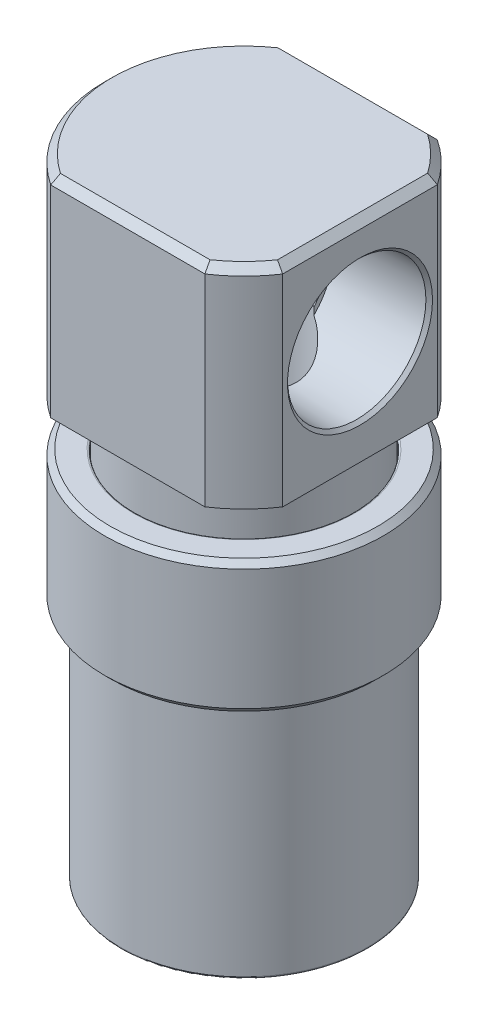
ISO-10303-21;
HEADER;
FILE_DESCRIPTION(('STEP AP214'),'2;1');
FILE_NAME('part.step','',(''),(''),'','','');
FILE_SCHEMA(('AUTOMOTIVE_DESIGN { 1 0 10303 214 1 1 1 1 }'));
ENDSEC;
DATA;
#1=APPLICATION_CONTEXT('core data for automotive mechanical design processes');
#2=APPLICATION_PROTOCOL_DEFINITION('international standard','automotive_design',2000,#1);
#3=PRODUCT_CONTEXT('',#1,'mechanical');
#4=PRODUCT('Part','Part','',(#3));
#5=PRODUCT_RELATED_PRODUCT_CATEGORY('part','',(#4));
#6=PRODUCT_DEFINITION_FORMATION('','',#4);
#7=PRODUCT_DEFINITION_CONTEXT('part definition',#1,'design');
#8=PRODUCT_DEFINITION('design','',#6,#7);
#9=PRODUCT_DEFINITION_SHAPE('','',#8);
#10=(LENGTH_UNIT() NAMED_UNIT(*) SI_UNIT(.MILLI.,.METRE.));
#11=(NAMED_UNIT(*) PLANE_ANGLE_UNIT() SI_UNIT($,.RADIAN.));
#12=(NAMED_UNIT(*) SI_UNIT($,.STERADIAN.) SOLID_ANGLE_UNIT());
#13=UNCERTAINTY_MEASURE_WITH_UNIT(LENGTH_MEASURE(1.E-05),#10,'distance_accuracy_value','');
#14=(GEOMETRIC_REPRESENTATION_CONTEXT(3) GLOBAL_UNCERTAINTY_ASSIGNED_CONTEXT((#13)) GLOBAL_UNIT_ASSIGNED_CONTEXT((#10,
#11,#12)) REPRESENTATION_CONTEXT('',''));
#15=CARTESIAN_POINT('',(0.,0.,0.));
#16=DIRECTION('',(0.,0.,1.));
#17=DIRECTION('',(1.,0.,0.));
#18=AXIS2_PLACEMENT_3D('',#15,#16,#17);
#19=CARTESIAN_POINT('',(0.,22.3012,0.));
#20=DIRECTION('',(0.,1.,0.));
#21=DIRECTION('',(0.,0.,1.));
#22=AXIS2_PLACEMENT_3D('',#19,#20,#21);
#23=CYLINDRICAL_SURFACE('',#22,3.5687);
#24=DIRECTION('',(0.,-1.,0.));
#25=VECTOR('',#24,1.);
#26=CARTESIAN_POINT('',(0.,22.3012,-3.5687));
#27=LINE('',#26,#25);
#28=CARTESIAN_POINT('',(0.,28.575,-3.5687));
#29=VERTEX_POINT('',#28);
#30=CARTESIAN_POINT('',(0.,12.8524,-3.5687));
#31=VERTEX_POINT('',#30);
#32=EDGE_CURVE('P0_E408',#29,#31,#27,.T.);
#33=ORIENTED_EDGE('',*,*,#32,.F.);
#34=ORIENTED_EDGE('',*,*,#32,.T.);
#35=CARTESIAN_POINT('',(0.,12.8524,0.));
#36=DIRECTION('',(0.,1.,0.));
#37=DIRECTION('',(1.,0.,0.));
#38=AXIS2_PLACEMENT_3D('',#35,#36,#37);
#39=CIRCLE('',#38,3.5687);
#40=CARTESIAN_POINT('',(0.,12.8524,3.5687));
#41=VERTEX_POINT('',#40);
#42=EDGE_CURVE('P0_E397',#41,#31,#39,.T.);
#43=ORIENTED_EDGE('',*,*,#42,.F.);
#44=CARTESIAN_POINT('',(0.,12.8524,0.));
#45=DIRECTION('',(0.,1.,0.));
#46=DIRECTION('',(1.,0.,0.));
#47=AXIS2_PLACEMENT_3D('',#44,#45,#46);
#48=CIRCLE('',#47,3.5687);
#49=EDGE_CURVE('P0_E393',#31,#41,#48,.T.);
#50=ORIENTED_EDGE('',*,*,#49,.F.);
#51=EDGE_LOOP('',(#33,#34,#43,#50));
#52=FACE_BOUND('',#51,.T.);
#53=CARTESIAN_POINT('',(1.5748,32.9760498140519,3.20244042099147));
#54=CARTESIAN_POINT('',(1.5174961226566,33.0089355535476,3.2306097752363));
#55=CARTESIAN_POINT('',(1.45918609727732,33.0412302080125,3.25738358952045));
#56=CARTESIAN_POINT('',(1.34031665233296,33.1041196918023,3.30807627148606));
#57=CARTESIAN_POINT('',(1.27975382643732,33.1347117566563,3.33199056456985));
#58=CARTESIAN_POINT('',(1.09276442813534,33.2238785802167,3.39988938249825));
#59=CARTESIAN_POINT('',(0.962739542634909,33.2788261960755,3.43918040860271));
#60=CARTESIAN_POINT('',(0.71714292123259,33.3637684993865,3.49775582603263));
#61=CARTESIAN_POINT('',(0.603082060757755,33.3964576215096,3.51934957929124));
#62=CARTESIAN_POINT('',(0.370592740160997,33.4456448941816,3.55132488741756));
#63=CARTESIAN_POINT('',(0.25219857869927,33.4622498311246,3.56178043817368));
#64=CARTESIAN_POINT('',(0.0127686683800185,33.476378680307,3.57069960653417));
#65=CARTESIAN_POINT('',(-0.108280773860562,33.4737451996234,3.56906430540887));
#66=CARTESIAN_POINT('',(-0.347885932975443,33.449585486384,3.55374350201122));
#67=CARTESIAN_POINT('',(-0.466433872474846,33.4280072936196,3.54002485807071));
#68=CARTESIAN_POINT('',(-0.731388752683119,33.3615559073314,3.49622960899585));
#69=CARTESIAN_POINT('',(-0.875905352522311,33.3117420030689,3.46256302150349));
#70=CARTESIAN_POINT('',(-1.15434385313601,33.1971123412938,3.37999262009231));
#71=CARTESIAN_POINT('',(-1.28822901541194,33.1322473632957,3.33103862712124));
#72=CARTESIAN_POINT('',(-1.51987589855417,33.0085957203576,3.23080869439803));
#73=CARTESIAN_POINT('',(-1.61948478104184,32.9512130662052,3.18198291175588));
#74=CARTESIAN_POINT('',(-1.81268107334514,32.833906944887,3.07602925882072));
#75=CARTESIAN_POINT('',(-1.9062650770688,32.7739820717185,3.0188967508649));
#76=CARTESIAN_POINT('',(-2.08758573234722,32.653486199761,2.89647597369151));
#77=CARTESIAN_POINT('',(-2.17531926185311,32.5929148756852,2.83118340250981));
#78=CARTESIAN_POINT('',(-2.3447598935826,32.4727131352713,2.69252578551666));
#79=CARTESIAN_POINT('',(-2.42646899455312,32.4130824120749,2.61916343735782));
#80=CARTESIAN_POINT('',(-2.64031801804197,32.2538567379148,2.40841211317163));
#81=CARTESIAN_POINT('',(-2.7663460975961,32.1564438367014,2.2629946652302));
#82=CARTESIAN_POINT('',(-2.99599895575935,31.9752874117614,1.94863924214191));
#83=CARTESIAN_POINT('',(-3.09971733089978,31.8914871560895,1.77980462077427));
#84=CARTESIAN_POINT('',(-3.22550458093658,31.7886256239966,1.52908096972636));
#85=CARTESIAN_POINT('',(-3.25905298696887,31.7610325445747,1.45626673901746));
#86=CARTESIAN_POINT('',(-3.32154219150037,31.7094184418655,1.30747092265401));
#87=CARTESIAN_POINT('',(-3.35048470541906,31.6853960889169,1.23149052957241));
#88=CARTESIAN_POINT('',(-3.40360037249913,31.6411667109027,1.07606529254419));
#89=CARTESIAN_POINT('',(-3.42773366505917,31.6209916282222,0.996597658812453));
#90=CARTESIAN_POINT('',(-3.4706116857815,31.5850561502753,0.835152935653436));
#91=CARTESIAN_POINT('',(-3.48935038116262,31.5693006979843,0.753173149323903));
#92=CARTESIAN_POINT('',(-3.5052,31.555958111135,0.670218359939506));
#93=B_SPLINE_CURVE_WITH_KNOTS('',3,(#53,#54,#55,#56,#57,#58,#59,#60,#61,#62,#63,#64,#65,#66,#67,
#68,#69,#70,#71,#72,#73,#74,#75,#76,#77,#78,#79,#80,#81,#82,#83,#84,#85,#86,#87,#88,#89,#90,#91,
#92),.UNSPECIFIED.,.F.,.F.,(4,2,2,2,2,2,2,2,2,2,2,2,2,2,2,2,2,2,2,4),(0.,0.215407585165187,
0.43115529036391,0.869087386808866,1.22956748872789,1.58763753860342,1.94864028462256,
2.31063626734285,2.77760727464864,3.24612746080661,3.62035472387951,3.9947917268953,
4.36942697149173,4.74393735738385,5.38845152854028,6.0302066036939,6.28436155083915,
6.5384216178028,6.79450704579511,7.05087775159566),.UNSPECIFIED.);
#94=CARTESIAN_POINT('',(1.5748,32.9760498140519,3.20244042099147));
#95=VERTEX_POINT('',#94);
#96=CARTESIAN_POINT('',(-3.5052,31.555958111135,0.670218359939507));
#97=VERTEX_POINT('',#96);
#98=EDGE_CURVE('P0_E280',#95,#97,#93,.T.);
#99=ORIENTED_EDGE('',*,*,#98,.F.);
#100=DIRECTION('',(0.,-1.,0.));
#101=VECTOR('',#100,1.);
#102=CARTESIAN_POINT('',(1.5748,34.925,3.20244042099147));
#103=LINE('',#102,#101);
#104=CARTESIAN_POINT('',(1.5748,32.4948135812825,3.20244042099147));
#105=VERTEX_POINT('',#104);
#106=EDGE_CURVE('P0_E267',#105,#95,#103,.F.);
#107=ORIENTED_EDGE('',*,*,#106,.F.);
#108=CARTESIAN_POINT('',(1.5746,32.4949197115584,-3.20253876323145));
#109=CARTESIAN_POINT('',(1.67366266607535,32.442279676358,-3.15378881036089));
#110=CARTESIAN_POINT('',(1.76978013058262,32.3880663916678,-3.10086309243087));
#111=CARTESIAN_POINT('',(1.9561370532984,32.2780606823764,-2.98683104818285));
#112=CARTESIAN_POINT('',(2.04637456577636,32.2222677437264,-2.9257220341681));
#113=CARTESIAN_POINT('',(2.22155084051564,32.1103028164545,-2.79505516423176));
#114=CARTESIAN_POINT('',(2.30644648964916,32.0541310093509,-2.72543931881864));
#115=CARTESIAN_POINT('',(2.46992007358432,31.9431758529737,-2.57821991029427));
#116=CARTESIAN_POINT('',(2.54849933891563,31.8883922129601,-2.50061803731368));
#117=CARTESIAN_POINT('',(2.75012858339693,31.7450746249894,-2.28192484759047));
#118=CARTESIAN_POINT('',(2.86711562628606,31.6589015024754,-2.13352223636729));
#119=CARTESIAN_POINT('',(3.0783529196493,31.5001752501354,-1.81538690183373));
#120=CARTESIAN_POINT('',(3.17267471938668,31.4275794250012,-1.64572394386));
#121=CARTESIAN_POINT('',(3.31960848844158,31.3131423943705,-1.319745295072));
#122=CARTESIAN_POINT('',(3.37668037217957,31.2681126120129,-1.16657533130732));
#123=CARTESIAN_POINT('',(3.46986187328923,31.1941729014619,-0.850188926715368));
#124=CARTESIAN_POINT('',(3.50597808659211,31.1652579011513,-0.686975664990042));
#125=CARTESIAN_POINT('',(3.55508529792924,31.1258677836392,-0.354111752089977));
#126=CARTESIAN_POINT('',(3.56797355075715,31.1154745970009,-0.184435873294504));
#127=CARTESIAN_POINT('',(3.56936605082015,31.1143538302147,0.155073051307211));
#128=CARTESIAN_POINT('',(3.55787359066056,31.1236235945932,0.324906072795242));
#129=CARTESIAN_POINT('',(3.51308778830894,31.1595607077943,0.646758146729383));
#130=CARTESIAN_POINT('',(3.48146319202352,31.1848958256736,0.799167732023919));
#131=CARTESIAN_POINT('',(3.39980475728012,31.249809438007,1.09572808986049));
#132=CARTESIAN_POINT('',(3.34976829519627,31.2893899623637,1.23987768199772));
#133=CARTESIAN_POINT('',(3.22920239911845,31.383701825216,1.52774771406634));
#134=CARTESIAN_POINT('',(3.15742840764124,31.4393390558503,1.67064357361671));
#135=CARTESIAN_POINT('',(2.99789829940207,31.5609193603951,1.94244817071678));
#136=CARTESIAN_POINT('',(2.91012878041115,31.6268710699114,2.07134503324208));
#137=CARTESIAN_POINT('',(2.70224101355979,31.7794792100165,2.33827061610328));
#138=CARTESIAN_POINT('',(2.57915567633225,31.867656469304,2.47310796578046));
#139=CARTESIAN_POINT('',(2.31592609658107,32.0485677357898,2.72118247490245));
#140=CARTESIAN_POINT('',(2.1757867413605,32.1413004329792,2.83442579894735));
#141=CARTESIAN_POINT('',(1.95589409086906,32.277824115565,2.98625276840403));
#142=CARTESIAN_POINT('',(1.88220876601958,32.322225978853,3.03325202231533));
#143=CARTESIAN_POINT('',(1.73118446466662,32.4097316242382,3.12189771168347));
#144=CARTESIAN_POINT('',(1.65385254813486,32.4528376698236,3.16355395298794));
#145=CARTESIAN_POINT('',(1.5746,32.4949197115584,3.20253876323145));
#146=B_SPLINE_CURVE_WITH_KNOTS('',3,(#108,#109,#110,#111,#112,#113,#114,#115,#116,#117,#118,
#119,#120,#121,#122,#123,#124,#125,#126,#127,#128,#129,#130,#131,#132,#133,#134,#135,#136,#137,
#138,#139,#140,#141,#142,#143,#144,#145),.UNSPECIFIED.,.F.,.F.,(4,2,2,2,2,2,2,2,2,2,2,2,2,2,2,2,
2,2,4),(0.,0.366764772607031,0.733650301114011,1.10319319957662,1.47265804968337,
2.09316921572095,2.71169504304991,3.21822583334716,3.7245971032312,4.2332027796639,
4.74173977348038,5.21280630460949,5.68393998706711,6.19001238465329,6.69651077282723,
7.30264315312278,7.90860223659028,8.20250443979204,8.49585929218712),.UNSPECIFIED.);
#147=CARTESIAN_POINT('',(1.5748,32.4948135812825,-3.20244042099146));
#148=VERTEX_POINT('',#147);
#149=EDGE_CURVE('P0_E262',#148,#105,#146,.T.);
#150=ORIENTED_EDGE('',*,*,#149,.F.);
#151=DIRECTION('',(0.,-1.,0.));
#152=VECTOR('',#151,1.);
#153=CARTESIAN_POINT('',(1.5748,34.925,-3.20244042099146));
#154=LINE('',#153,#152);
#155=CARTESIAN_POINT('',(1.5748,32.9760498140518,-3.20244042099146));
#156=VERTEX_POINT('',#155);
#157=EDGE_CURVE('P0_E264',#156,#148,#154,.T.);
#158=ORIENTED_EDGE('',*,*,#157,.F.);
#159=CARTESIAN_POINT('',(-3.5052,31.555958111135,-0.670218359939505));
#160=CARTESIAN_POINT('',(-3.48755494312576,31.5708107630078,-0.762593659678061));
#161=CARTESIAN_POINT('',(-3.46632402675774,31.5886601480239,-0.853748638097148));
#162=CARTESIAN_POINT('',(-3.4172198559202,31.6297879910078,-1.03286273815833));
#163=CARTESIAN_POINT('',(-3.38935558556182,31.6530591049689,-1.12082599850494));
#164=CARTESIAN_POINT('',(-3.32774479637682,31.7042753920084,-1.29227195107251));
#165=CARTESIAN_POINT('',(-3.29405397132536,31.7321762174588,-1.37578806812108));
#166=CARTESIAN_POINT('',(-3.22113854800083,31.7922099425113,-1.53878654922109));
#167=CARTESIAN_POINT('',(-3.18191218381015,31.8243441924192,-1.61826761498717));
#168=CARTESIAN_POINT('',(-3.05714646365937,31.9258356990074,-1.84931645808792));
#169=CARTESIAN_POINT('',(-2.96412648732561,32.0006133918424,-1.99455897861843));
#170=CARTESIAN_POINT('',(-2.76134083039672,32.1601694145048,-2.26707256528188));
#171=CARTESIAN_POINT('',(-2.6515277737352,32.2449758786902,-2.39429076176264));
#172=CARTESIAN_POINT('',(-2.39685574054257,32.4356324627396,-2.65121909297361));
#173=CARTESIAN_POINT('',(-2.24923140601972,32.5425565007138,-2.77741368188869));
#174=CARTESIAN_POINT('',(-2.0141616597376,32.7027893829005,-2.94756124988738));
#175=CARTESIAN_POINT('',(-1.9335063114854,32.7561910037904,-3.00109973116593));
#176=CARTESIAN_POINT('',(-1.76752297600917,32.8617510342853,-3.10175705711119));
#177=CARTESIAN_POINT('',(-1.68219635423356,32.9139098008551,-3.14887776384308));
#178=CARTESIAN_POINT('',(-1.46980256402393,33.0368985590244,-3.25495726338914));
#179=CARTESIAN_POINT('',(-1.34024824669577,33.1063761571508,-3.31058313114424));
#180=CARTESIAN_POINT('',(-1.07051188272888,33.2339284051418,-3.4073566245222));
#181=CARTESIAN_POINT('',(-0.930348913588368,33.2920228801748,-3.4485295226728));
#182=CARTESIAN_POINT('',(-0.67601684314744,33.3759062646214,-3.50585761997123));
#183=CARTESIAN_POINT('',(-0.56419885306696,33.4061469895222,-3.52570269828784));
#184=CARTESIAN_POINT('',(-0.336219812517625,33.4509173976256,-3.55467337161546));
#185=CARTESIAN_POINT('',(-0.220070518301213,33.4654868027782,-3.56382607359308));
#186=CARTESIAN_POINT('',(0.014079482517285,33.4762296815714,-3.57060078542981));
#187=CARTESIAN_POINT('',(0.132086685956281,33.4723068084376,-3.56816240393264));
#188=CARTESIAN_POINT('',(0.365476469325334,33.4466529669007,-3.55187340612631));
#189=CARTESIAN_POINT('',(0.480852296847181,33.4248805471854,-3.53799622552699));
#190=CARTESIAN_POINT('',(0.743842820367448,33.3577145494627,-3.49365255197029));
#191=CARTESIAN_POINT('',(0.889325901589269,33.3068545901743,-3.4591886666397));
#192=CARTESIAN_POINT('',(1.16925947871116,33.1902597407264,-3.37489541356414));
#193=CARTESIAN_POINT('',(1.30369542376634,33.1245056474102,-3.32504617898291));
#194=CARTESIAN_POINT('',(1.45693751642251,33.0420584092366,-3.25785755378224));
#195=CARTESIAN_POINT('',(1.48078907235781,33.0289983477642,-3.24708530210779));
#196=CARTESIAN_POINT('',(1.5280823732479,33.002676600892,-3.22509913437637));
#197=CARTESIAN_POINT('',(1.55152500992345,32.9894155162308,-3.21388641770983));
#198=CARTESIAN_POINT('',(1.57480000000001,32.9760498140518,-3.20244042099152));
#199=B_SPLINE_CURVE_WITH_KNOTS('',3,(#159,#160,#161,#162,#163,#164,#165,#166,#167,#168,#169,
#170,#171,#172,#173,#174,#175,#176,#177,#178,#179,#180,#181,#182,#183,#184,#185,#186,#187,#188,
#189,#190,#191,#192,#193,#194,#195,#196,#197,#198),.UNSPECIFIED.,.F.,.F.,(4,2,2,2,2,2,2,2,2,2,2,
2,2,2,2,2,2,2,2,4),(0.,0.28543582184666,0.57048723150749,0.852951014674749,1.1355051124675,
1.69709611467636,2.26030172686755,2.92281003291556,3.25426550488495,3.5856246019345,
4.05606882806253,4.52568628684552,4.87695323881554,5.2273277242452,5.57952971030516,
5.93255192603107,6.40370785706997,6.87547474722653,6.96322097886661,7.05074290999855),.UNSPECIFIED.);
#200=CARTESIAN_POINT('',(-3.5052,31.555958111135,-0.670218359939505));
#201=VERTEX_POINT('',#200);
#202=EDGE_CURVE('P0_E497',#201,#156,#199,.T.);
#203=ORIENTED_EDGE('',*,*,#202,.F.);
#204=CARTESIAN_POINT('',(-3.49864999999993,31.5504162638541,0.703610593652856));
#205=CARTESIAN_POINT('',(-3.5139483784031,31.563371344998,0.627622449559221));
#206=CARTESIAN_POINT('',(-3.52681281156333,31.5740531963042,0.550767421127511));
#207=CARTESIAN_POINT('',(-3.54752954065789,31.5910542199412,0.395889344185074));
#208=CARTESIAN_POINT('',(-3.55538076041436,31.5973724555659,0.317866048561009));
#209=CARTESIAN_POINT('',(-3.56580918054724,31.6057356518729,0.1628989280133));
#210=CARTESIAN_POINT('',(-3.56849393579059,31.6078677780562,0.0859669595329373));
#211=CARTESIAN_POINT('',(-3.56888316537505,31.6081774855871,-0.0678872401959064));
#212=CARTESIAN_POINT('',(-3.56658955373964,31.6063565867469,-0.144809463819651));
#213=CARTESIAN_POINT('',(-3.55678884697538,31.5985065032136,-0.302377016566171));
#214=CARTESIAN_POINT('',(-3.54900150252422,31.5922510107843,-0.382994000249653));
#215=CARTESIAN_POINT('',(-3.52795283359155,31.5749967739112,-0.543935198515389));
#216=CARTESIAN_POINT('',(-3.51463046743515,31.5639450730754,-0.624245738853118));
#217=CARTESIAN_POINT('',(-3.49865,31.5504162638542,-0.703610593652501));
#218=B_SPLINE_CURVE_WITH_KNOTS('',3,(#204,#205,#206,#207,#208,#209,#210,#211,#212,#213,#214,
#215,#216,#217),.UNSPECIFIED.,.F.,.F.,(4,2,2,2,2,2,4),(0.,0.235674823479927,0.471400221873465,
0.702162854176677,0.93283678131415,1.1762185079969,1.42235872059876),.UNSPECIFIED.);
#219=EDGE_CURVE('P0_E502',#97,#201,#218,.T.);
#220=ORIENTED_EDGE('',*,*,#219,.F.);
#221=EDGE_LOOP('',(#99,#107,#150,#158,#203,#220));
#222=FACE_BOUND('',#221,.T.);
#223=ADVANCED_FACE('P0_F50',(#52,#222),#23,.F.);
#224=CARTESIAN_POINT('',(0.,28.2575,0.));
#225=DIRECTION('',(0.,1.,0.));
#226=DIRECTION('',(0.,0.,1.));
#227=AXIS2_PLACEMENT_3D('',#224,#225,#226);
#228=CYLINDRICAL_SURFACE('',#227,7.4041);
#229=DIRECTION('',(0.,-1.,0.));
#230=VECTOR('',#229,1.);
#231=CARTESIAN_POINT('',(0.,28.2575,-7.4041));
#232=LINE('',#231,#230);
#233=CARTESIAN_POINT('',(0.,25.1459996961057,-7.4041));
#234=VERTEX_POINT('',#233);
#235=CARTESIAN_POINT('',(0.,15.24,-7.4041));
#236=VERTEX_POINT('',#235);
#237=EDGE_CURVE('P0_E443',#234,#236,#232,.T.);
#238=ORIENTED_EDGE('',*,*,#237,.F.);
#239=ORIENTED_EDGE('',*,*,#237,.T.);
#240=CARTESIAN_POINT('',(0.,15.24,0.));
#241=DIRECTION('',(0.,1.,0.));
#242=DIRECTION('',(1.,0.,0.));
#243=AXIS2_PLACEMENT_3D('',#240,#241,#242);
#244=CIRCLE('',#243,7.4041);
#245=CARTESIAN_POINT('',(0.,15.24,7.4041));
#246=VERTEX_POINT('',#245);
#247=EDGE_CURVE('P0_E440',#236,#246,#244,.T.);
#248=ORIENTED_EDGE('',*,*,#247,.T.);
#249=CARTESIAN_POINT('',(0.,15.24,0.));
#250=DIRECTION('',(0.,1.,0.));
#251=DIRECTION('',(1.,0.,0.));
#252=AXIS2_PLACEMENT_3D('',#249,#250,#251);
#253=CIRCLE('',#252,7.4041);
#254=EDGE_CURVE('P0_E436',#246,#236,#253,.T.);
#255=ORIENTED_EDGE('',*,*,#254,.T.);
#256=EDGE_LOOP('',(#238,#239,#248,#255));
#257=FACE_BOUND('',#256,.T.);
#258=DIRECTION('',(0.,-1.,0.));
#259=VECTOR('',#258,1.);
#260=CARTESIAN_POINT('',(0.,28.2575,-7.4041));
#261=LINE('',#260,#259);
#262=CARTESIAN_POINT('',(0.,28.575,-7.4041));
#263=VERTEX_POINT('',#262);
#264=CARTESIAN_POINT('',(0.,28.4479996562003,-7.4041));
#265=VERTEX_POINT('',#264);
#266=EDGE_CURVE('P0_E392',#263,#265,#261,.T.);
#267=ORIENTED_EDGE('',*,*,#266,.F.);
#268=CARTESIAN_POINT('',(0.,28.575,0.));
#269=DIRECTION('',(0.,1.,0.));
#270=DIRECTION('',(0.,0.,1.));
#271=AXIS2_PLACEMENT_3D('',#268,#269,#270);
#272=CIRCLE('',#271,7.4041);
#273=EDGE_CURVE('P0_E317',#263,#263,#272,.F.);
#274=ORIENTED_EDGE('',*,*,#273,.T.);
#275=ORIENTED_EDGE('',*,*,#266,.T.);
#276=EDGE_LOOP('',(#267,#274,#275));
#277=FACE_BOUND('',#276,.T.);
#278=ADVANCED_FACE('P0_F551',(#257,#277),#228,.T.);
#279=CARTESIAN_POINT('',(0.,0.3937,0.));
#280=DIRECTION('',(0.,-1.,0.));
#281=DIRECTION('',(0.,0.,-1.));
#282=AXIS2_PLACEMENT_3D('',#279,#280,#281);
#283=CONICAL_SURFACE('',#282,5.1689,0.785398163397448);
#284=CARTESIAN_POINT('',(0.,0.,0.));
#285=DIRECTION('',(0.,-1.,0.));
#286=DIRECTION('',(0.,0.,-1.));
#287=AXIS2_PLACEMENT_3D('',#284,#285,#286);
#288=CIRCLE('',#287,5.5626);
#289=CARTESIAN_POINT('',(0.,0.,5.5626));
#290=VERTEX_POINT('',#289);
#291=EDGE_CURVE('P0_E272',#290,#290,#288,.T.);
#292=ORIENTED_EDGE('',*,*,#291,.T.);
#293=DIRECTION('',(0.,0.707106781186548,-0.707106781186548));
#294=VECTOR('',#293,1.);
#295=CARTESIAN_POINT('',(0.,0.3937,5.1689));
#296=LINE('',#295,#294);
#297=CARTESIAN_POINT('',(0.,0.7874,4.7752));
#298=VERTEX_POINT('',#297);
#299=EDGE_CURVE('P0_E335',#290,#298,#296,.T.);
#300=ORIENTED_EDGE('',*,*,#299,.T.);
#301=CARTESIAN_POINT('',(0.,0.7874,0.));
#302=DIRECTION('',(0.,1.,0.));
#303=DIRECTION('',(0.,0.,-1.));
#304=AXIS2_PLACEMENT_3D('',#301,#302,#303);
#305=CIRCLE('',#304,4.7752);
#306=CARTESIAN_POINT('',(0.,0.7874,-4.7752));
#307=VERTEX_POINT('',#306);
#308=EDGE_CURVE('P0_E333',#298,#307,#305,.T.);
#309=ORIENTED_EDGE('',*,*,#308,.T.);
#310=CARTESIAN_POINT('',(0.,0.7874,0.));
#311=DIRECTION('',(0.,1.,0.));
#312=DIRECTION('',(0.,0.,-1.));
#313=AXIS2_PLACEMENT_3D('',#310,#311,#312);
#314=CIRCLE('',#313,4.7752);
#315=EDGE_CURVE('P0_E329',#307,#298,#314,.T.);
#316=ORIENTED_EDGE('',*,*,#315,.T.);
#317=ORIENTED_EDGE('',*,*,#299,.F.);
#318=EDGE_LOOP('',(#292,#300,#309,#316,#317));
#319=FACE_BOUND('',#318,.T.);
#320=ADVANCED_FACE('P0_F547',(#319),#283,.F.);
#321=CARTESIAN_POINT('',(0.,4.05954416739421,0.));
#322=DIRECTION('',(0.,1.,0.));
#323=DIRECTION('',(0.,0.,1.));
#324=AXIS2_PLACEMENT_3D('',#321,#322,#323);
#325=CYLINDRICAL_SURFACE('',#324,4.7752);
#326=CARTESIAN_POINT('',(0.,8.11908833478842,0.));
#327=DIRECTION('',(0.,1.,0.));
#328=DIRECTION('',(1.,0.,0.));
#329=AXIS2_PLACEMENT_3D('',#326,#327,#328);
#330=CIRCLE('',#329,4.7752);
#331=CARTESIAN_POINT('',(0.,8.11908833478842,4.7752));
#332=VERTEX_POINT('',#331);
#333=CARTESIAN_POINT('',(0.,8.11908833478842,-4.7752));
#334=VERTEX_POINT('',#333);
#335=EDGE_CURVE('P0_E334',#332,#334,#330,.T.);
#336=ORIENTED_EDGE('',*,*,#335,.T.);
#337=DIRECTION('',(0.,-1.,0.));
#338=VECTOR('',#337,1.);
#339=CARTESIAN_POINT('',(0.,4.05954416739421,-4.7752));
#340=LINE('',#339,#338);
#341=EDGE_CURVE('P0_E376',#334,#307,#340,.T.);
#342=ORIENTED_EDGE('',*,*,#341,.T.);
#343=ORIENTED_EDGE('',*,*,#308,.F.);
#344=ORIENTED_EDGE('',*,*,#315,.F.);
#345=ORIENTED_EDGE('',*,*,#341,.F.);
#346=CARTESIAN_POINT('',(0.,8.11908833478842,0.));
#347=DIRECTION('',(0.,1.,0.));
#348=DIRECTION('',(1.,0.,0.));
#349=AXIS2_PLACEMENT_3D('',#346,#347,#348);
#350=CIRCLE('',#349,4.7752);
#351=EDGE_CURVE('P0_E380',#334,#332,#350,.T.);
#352=ORIENTED_EDGE('',*,*,#351,.T.);
#353=EDGE_LOOP('',(#336,#342,#343,#344,#345,#352));
#354=FACE_BOUND('',#353,.T.);
#355=ADVANCED_FACE('P0_F550',(#354),#325,.F.);
#356=CARTESIAN_POINT('',(0.,0.,6.35));
#357=DIRECTION('',(0.,-1.,0.));
#358=DIRECTION('',(0.,0.,-1.));
#359=AXIS2_PLACEMENT_3D('',#356,#357,#358);
#360=PLANE('',#359);
#361=CARTESIAN_POINT('',(0.,0.,0.));
#362=DIRECTION('',(0.,1.,0.));
#363=DIRECTION('',(1.,0.,0.));
#364=AXIS2_PLACEMENT_3D('',#361,#362,#363);
#365=CIRCLE('',#364,6.35);
#366=CARTESIAN_POINT('',(0.,0.,6.35));
#367=VERTEX_POINT('',#366);
#368=CARTESIAN_POINT('',(0.,0.,-6.35));
#369=VERTEX_POINT('',#368);
#370=EDGE_CURVE('P0_E385',#367,#369,#365,.T.);
#371=ORIENTED_EDGE('',*,*,#370,.F.);
#372=CARTESIAN_POINT('',(0.,0.,0.));
#373=DIRECTION('',(0.,1.,0.));
#374=DIRECTION('',(1.,0.,0.));
#375=AXIS2_PLACEMENT_3D('',#372,#373,#374);
#376=CIRCLE('',#375,6.35);
#377=EDGE_CURVE('P0_E388',#369,#367,#376,.T.);
#378=ORIENTED_EDGE('',*,*,#377,.F.);
#379=EDGE_LOOP('',(#371,#378));
#380=FACE_BOUND('',#379,.T.);
#381=ORIENTED_EDGE('',*,*,#291,.F.);
#382=EDGE_LOOP('',(#381));
#383=FACE_BOUND('',#382,.T.);
#384=ADVANCED_FACE('P0_F571',(#380,#383),#360,.T.);
#385=CARTESIAN_POINT('',(0.,12.8524,5.0546));
#386=DIRECTION('',(0.,-1.,0.));
#387=DIRECTION('',(0.,0.,-1.));
#388=AXIS2_PLACEMENT_3D('',#385,#386,#387);
#389=PLANE('',#388);
#390=CARTESIAN_POINT('',(0.,12.8524,0.));
#391=DIRECTION('',(0.,1.,0.));
#392=DIRECTION('',(1.,0.,0.));
#393=AXIS2_PLACEMENT_3D('',#390,#391,#392);
#394=CIRCLE('',#393,5.0546);
#395=CARTESIAN_POINT('',(0.,12.8524,5.0546));
#396=VERTEX_POINT('',#395);
#397=CARTESIAN_POINT('',(0.,12.8524,-5.0546));
#398=VERTEX_POINT('',#397);
#399=EDGE_CURVE('P0_E398',#396,#398,#394,.T.);
#400=ORIENTED_EDGE('',*,*,#399,.F.);
#401=CARTESIAN_POINT('',(0.,12.8524,0.));
#402=DIRECTION('',(0.,1.,0.));
#403=DIRECTION('',(1.,0.,0.));
#404=AXIS2_PLACEMENT_3D('',#401,#402,#403);
#405=CIRCLE('',#404,5.0546);
#406=EDGE_CURVE('P0_E384',#398,#396,#405,.T.);
#407=ORIENTED_EDGE('',*,*,#406,.F.);
#408=EDGE_LOOP('',(#400,#407));
#409=FACE_BOUND('',#408,.T.);
#410=ORIENTED_EDGE('',*,*,#42,.T.);
#411=ORIENTED_EDGE('',*,*,#49,.T.);
#412=EDGE_LOOP('',(#410,#411));
#413=FACE_BOUND('',#412,.T.);
#414=ADVANCED_FACE('P0_F567',(#409,#413),#389,.T.);
#415=CARTESIAN_POINT('',(0.,12.2174,0.));
#416=DIRECTION('',(0.,1.,0.));
#417=DIRECTION('',(0.,0.,1.));
#418=AXIS2_PLACEMENT_3D('',#415,#416,#417);
#419=CYLINDRICAL_SURFACE('',#418,5.0546);
#420=ORIENTED_EDGE('',*,*,#399,.T.);
#421=DIRECTION('',(0.,-1.,0.));
#422=VECTOR('',#421,1.);
#423=CARTESIAN_POINT('',(0.,12.2174,-5.0546));
#424=LINE('',#423,#422);
#425=CARTESIAN_POINT('',(0.,11.5824,-5.0546));
#426=VERTEX_POINT('',#425);
#427=EDGE_CURVE('P0_E412',#398,#426,#424,.T.);
#428=ORIENTED_EDGE('',*,*,#427,.T.);
#429=CARTESIAN_POINT('',(0.,11.5824,0.));
#430=DIRECTION('',(0.,1.,0.));
#431=DIRECTION('',(1.,0.,0.));
#432=AXIS2_PLACEMENT_3D('',#429,#430,#431);
#433=CIRCLE('',#432,5.0546);
#434=CARTESIAN_POINT('',(0.,11.5824,5.0546));
#435=VERTEX_POINT('',#434);
#436=EDGE_CURVE('P0_E364',#435,#426,#433,.T.);
#437=ORIENTED_EDGE('',*,*,#436,.F.);
#438=CARTESIAN_POINT('',(0.,11.5824,0.));
#439=DIRECTION('',(0.,1.,0.));
#440=DIRECTION('',(1.,0.,0.));
#441=AXIS2_PLACEMENT_3D('',#438,#439,#440);
#442=CIRCLE('',#441,5.0546);
#443=EDGE_CURVE('P0_E365',#426,#435,#442,.T.);
#444=ORIENTED_EDGE('',*,*,#443,.F.);
#445=ORIENTED_EDGE('',*,*,#427,.F.);
#446=ORIENTED_EDGE('',*,*,#406,.T.);
#447=EDGE_LOOP('',(#420,#428,#437,#444,#445,#446));
#448=FACE_BOUND('',#447,.T.);
#449=ADVANCED_FACE('P0_F570',(#448),#419,.F.);
#450=CARTESIAN_POINT('',(0.,11.4650824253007,0.));
#451=DIRECTION('',(0.,-1.,0.));
#452=DIRECTION('',(0.,0.,1.));
#453=AXIS2_PLACEMENT_3D('',#450,#451,#452);
#454=CONICAL_SURFACE('',#453,5.2578,1.04719755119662);
#455=ORIENTED_EDGE('',*,*,#436,.T.);
#456=DIRECTION('',(0.,-0.499999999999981,-0.86602540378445));
#457=VECTOR('',#456,1.);
#458=CARTESIAN_POINT('',(0.,11.4650824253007,-5.2578));
#459=LINE('',#458,#457);
#460=CARTESIAN_POINT('',(0.,11.3477648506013,-5.461));
#461=VERTEX_POINT('',#460);
#462=EDGE_CURVE('P0_E360',#426,#461,#459,.T.);
#463=ORIENTED_EDGE('',*,*,#462,.T.);
#464=CARTESIAN_POINT('',(0.,11.3477648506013,0.));
#465=DIRECTION('',(0.,1.,0.));
#466=DIRECTION('',(1.,0.,0.));
#467=AXIS2_PLACEMENT_3D('',#464,#465,#466);
#468=CIRCLE('',#467,5.461);
#469=CARTESIAN_POINT('',(0.,11.3477648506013,5.461));
#470=VERTEX_POINT('',#469);
#471=EDGE_CURVE('P0_E366',#470,#461,#468,.T.);
#472=ORIENTED_EDGE('',*,*,#471,.F.);
#473=CARTESIAN_POINT('',(0.,11.3477648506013,0.));
#474=DIRECTION('',(0.,1.,0.));
#475=DIRECTION('',(1.,0.,0.));
#476=AXIS2_PLACEMENT_3D('',#473,#474,#475);
#477=CIRCLE('',#476,5.461);
#478=EDGE_CURVE('P0_E359',#461,#470,#477,.T.);
#479=ORIENTED_EDGE('',*,*,#478,.F.);
#480=ORIENTED_EDGE('',*,*,#462,.F.);
#481=ORIENTED_EDGE('',*,*,#443,.T.);
#482=EDGE_LOOP('',(#455,#463,#472,#479,#480,#481));
#483=FACE_BOUND('',#482,.T.);
#484=ADVANCED_FACE('P0_F557',(#483),#454,.F.);
#485=CARTESIAN_POINT('',(0.,10.3952648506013,0.));
#486=DIRECTION('',(0.,1.,0.));
#487=DIRECTION('',(0.,0.,1.));
#488=AXIS2_PLACEMENT_3D('',#485,#486,#487);
#489=CYLINDRICAL_SURFACE('',#488,5.461);
#490=ORIENTED_EDGE('',*,*,#471,.T.);
#491=DIRECTION('',(0.,-1.,0.));
#492=VECTOR('',#491,1.);
#493=CARTESIAN_POINT('',(0.,10.3952648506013,-5.461));
#494=LINE('',#493,#492);
#495=CARTESIAN_POINT('',(0.,9.44276485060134,-5.461));
#496=VERTEX_POINT('',#495);
#497=EDGE_CURVE('P0_E370',#461,#496,#494,.T.);
#498=ORIENTED_EDGE('',*,*,#497,.T.);
#499=CARTESIAN_POINT('',(0.,9.44276485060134,0.));
#500=DIRECTION('',(0.,1.,0.));
#501=DIRECTION('',(1.,0.,0.));
#502=AXIS2_PLACEMENT_3D('',#499,#500,#501);
#503=CIRCLE('',#502,5.461);
#504=CARTESIAN_POINT('',(0.,9.44276485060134,5.461));
#505=VERTEX_POINT('',#504);
#506=EDGE_CURVE('P0_E354',#505,#496,#503,.T.);
#507=ORIENTED_EDGE('',*,*,#506,.F.);
#508=CARTESIAN_POINT('',(0.,9.44276485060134,0.));
#509=DIRECTION('',(0.,1.,0.));
#510=DIRECTION('',(1.,0.,0.));
#511=AXIS2_PLACEMENT_3D('',#508,#509,#510);
#512=CIRCLE('',#511,5.461);
#513=EDGE_CURVE('P0_E355',#496,#505,#512,.T.);
#514=ORIENTED_EDGE('',*,*,#513,.F.);
#515=ORIENTED_EDGE('',*,*,#497,.F.);
#516=ORIENTED_EDGE('',*,*,#478,.T.);
#517=EDGE_LOOP('',(#490,#498,#507,#514,#515,#516));
#518=FACE_BOUND('',#517,.T.);
#519=ADVANCED_FACE('P0_F553',(#518),#489,.F.);
#520=CARTESIAN_POINT('',(0.,9.325447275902,0.));
#521=DIRECTION('',(0.,1.,0.));
#522=DIRECTION('',(0.,0.,1.));
#523=AXIS2_PLACEMENT_3D('',#520,#521,#522);
#524=CONICAL_SURFACE('',#523,5.2578,1.04719755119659);
#525=ORIENTED_EDGE('',*,*,#506,.T.);
#526=DIRECTION('',(0.,-0.500000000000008,0.866025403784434));
#527=VECTOR('',#526,1.);
#528=CARTESIAN_POINT('',(0.,9.325447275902,-5.2578));
#529=LINE('',#528,#527);
#530=CARTESIAN_POINT('',(0.,9.20812970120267,-5.0546));
#531=VERTEX_POINT('',#530);
#532=EDGE_CURVE('P0_E350',#496,#531,#529,.T.);
#533=ORIENTED_EDGE('',*,*,#532,.T.);
#534=CARTESIAN_POINT('',(0.,9.20812970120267,0.));
#535=DIRECTION('',(0.,1.,0.));
#536=DIRECTION('',(1.,0.,0.));
#537=AXIS2_PLACEMENT_3D('',#534,#535,#536);
#538=CIRCLE('',#537,5.0546);
#539=CARTESIAN_POINT('',(0.,9.20812970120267,5.0546));
#540=VERTEX_POINT('',#539);
#541=EDGE_CURVE('P0_E371',#540,#531,#538,.T.);
#542=ORIENTED_EDGE('',*,*,#541,.F.);
#543=CARTESIAN_POINT('',(0.,9.20812970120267,0.));
#544=DIRECTION('',(0.,1.,0.));
#545=DIRECTION('',(1.,0.,0.));
#546=AXIS2_PLACEMENT_3D('',#543,#544,#545);
#547=CIRCLE('',#546,5.0546);
#548=EDGE_CURVE('P0_E343',#531,#540,#547,.T.);
#549=ORIENTED_EDGE('',*,*,#548,.F.);
#550=ORIENTED_EDGE('',*,*,#532,.F.);
#551=ORIENTED_EDGE('',*,*,#513,.T.);
#552=EDGE_LOOP('',(#525,#533,#542,#549,#550,#551));
#553=FACE_BOUND('',#552,.T.);
#554=ADVANCED_FACE('P0_F556',(#553),#524,.F.);
#555=CARTESIAN_POINT('',(0.,8.74426485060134,0.));
#556=DIRECTION('',(0.,1.,0.));
#557=DIRECTION('',(0.,0.,1.));
#558=AXIS2_PLACEMENT_3D('',#555,#556,#557);
#559=CYLINDRICAL_SURFACE('',#558,5.0546);
#560=ORIENTED_EDGE('',*,*,#541,.T.);
#561=DIRECTION('',(0.,-1.,0.));
#562=VECTOR('',#561,1.);
#563=CARTESIAN_POINT('',(0.,8.74426485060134,-5.0546));
#564=LINE('',#563,#562);
#565=CARTESIAN_POINT('',(0.,8.2804,-5.0546));
#566=VERTEX_POINT('',#565);
#567=EDGE_CURVE('P0_E375',#531,#566,#564,.T.);
#568=ORIENTED_EDGE('',*,*,#567,.T.);
#569=CARTESIAN_POINT('',(0.,8.2804,0.));
#570=DIRECTION('',(0.,1.,0.));
#571=DIRECTION('',(1.,0.,0.));
#572=AXIS2_PLACEMENT_3D('',#569,#570,#571);
#573=CIRCLE('',#572,5.0546);
#574=CARTESIAN_POINT('',(0.,8.2804,5.0546));
#575=VERTEX_POINT('',#574);
#576=EDGE_CURVE('P0_E339',#575,#566,#573,.T.);
#577=ORIENTED_EDGE('',*,*,#576,.F.);
#578=CARTESIAN_POINT('',(0.,8.2804,0.));
#579=DIRECTION('',(0.,1.,0.));
#580=DIRECTION('',(1.,0.,0.));
#581=AXIS2_PLACEMENT_3D('',#578,#579,#580);
#582=CIRCLE('',#581,5.0546);
#583=EDGE_CURVE('P0_E413',#566,#575,#582,.T.);
#584=ORIENTED_EDGE('',*,*,#583,.F.);
#585=ORIENTED_EDGE('',*,*,#567,.F.);
#586=ORIENTED_EDGE('',*,*,#548,.T.);
#587=EDGE_LOOP('',(#560,#568,#577,#584,#585,#586));
#588=FACE_BOUND('',#587,.T.);
#589=ADVANCED_FACE('P0_F559',(#588),#559,.F.);
#590=CARTESIAN_POINT('',(0.,8.19974416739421,0.));
#591=DIRECTION('',(0.,1.,0.));
#592=DIRECTION('',(0.,0.,1.));
#593=AXIS2_PLACEMENT_3D('',#590,#591,#592);
#594=CONICAL_SURFACE('',#593,4.9149,1.04719755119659);
#595=ORIENTED_EDGE('',*,*,#576,.T.);
#596=DIRECTION('',(0.,-0.5,0.866025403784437));
#597=VECTOR('',#596,1.);
#598=CARTESIAN_POINT('',(0.,8.19974416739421,-4.9149));
#599=LINE('',#598,#597);
#600=EDGE_CURVE('P0_E344',#566,#334,#599,.T.);
#601=ORIENTED_EDGE('',*,*,#600,.T.);
#602=ORIENTED_EDGE('',*,*,#335,.F.);
#603=ORIENTED_EDGE('',*,*,#351,.F.);
#604=ORIENTED_EDGE('',*,*,#600,.F.);
#605=ORIENTED_EDGE('',*,*,#583,.T.);
#606=EDGE_LOOP('',(#595,#601,#602,#603,#604,#605));
#607=FACE_BOUND('',#606,.T.);
#608=ADVANCED_FACE('P0_F562',(#607),#594,.F.);
#609=CARTESIAN_POINT('',(0.,7.62,0.));
#610=DIRECTION('',(0.,1.,0.));
#611=DIRECTION('',(0.,0.,1.));
#612=AXIS2_PLACEMENT_3D('',#609,#610,#611);
#613=CYLINDRICAL_SURFACE('',#612,6.35);
#614=CARTESIAN_POINT('',(0.,15.24,0.));
#615=DIRECTION('',(0.,1.,0.));
#616=DIRECTION('',(1.,0.,0.));
#617=AXIS2_PLACEMENT_3D('',#614,#615,#616);
#618=CIRCLE('',#617,6.35);
#619=CARTESIAN_POINT('',(0.,15.24,6.35));
#620=VERTEX_POINT('',#619);
#621=CARTESIAN_POINT('',(0.,15.24,-6.35));
#622=VERTEX_POINT('',#621);
#623=EDGE_CURVE('P0_E349',#620,#622,#618,.T.);
#624=ORIENTED_EDGE('',*,*,#623,.F.);
#625=CARTESIAN_POINT('',(0.,15.24,0.));
#626=DIRECTION('',(0.,1.,0.));
#627=DIRECTION('',(1.,0.,0.));
#628=AXIS2_PLACEMENT_3D('',#625,#626,#627);
#629=CIRCLE('',#628,6.35);
#630=EDGE_CURVE('P0_E345',#622,#620,#629,.T.);
#631=ORIENTED_EDGE('',*,*,#630,.F.);
#632=DIRECTION('',(0.,-1.,0.));
#633=VECTOR('',#632,1.);
#634=CARTESIAN_POINT('',(0.,7.62,-6.35));
#635=LINE('',#634,#633);
#636=EDGE_CURVE('P0_E417',#622,#369,#635,.T.);
#637=ORIENTED_EDGE('',*,*,#636,.T.);
#638=ORIENTED_EDGE('',*,*,#377,.T.);
#639=ORIENTED_EDGE('',*,*,#370,.T.);
#640=ORIENTED_EDGE('',*,*,#636,.F.);
#641=EDGE_LOOP('',(#624,#631,#637,#638,#639,#640));
#642=FACE_BOUND('',#641,.T.);
#643=ADVANCED_FACE('P0_F590',(#642),#613,.T.);
#644=CARTESIAN_POINT('',(0.,15.24,7.4041));
#645=DIRECTION('',(0.,-1.,0.));
#646=DIRECTION('',(0.,0.,-1.));
#647=AXIS2_PLACEMENT_3D('',#644,#645,#646);
#648=PLANE('',#647);
#649=ORIENTED_EDGE('',*,*,#254,.F.);
#650=ORIENTED_EDGE('',*,*,#247,.F.);
#651=EDGE_LOOP('',(#649,#650));
#652=FACE_BOUND('',#651,.T.);
#653=ORIENTED_EDGE('',*,*,#623,.T.);
#654=ORIENTED_EDGE('',*,*,#630,.T.);
#655=EDGE_LOOP('',(#653,#654));
#656=FACE_BOUND('',#655,.T.);
#657=ADVANCED_FACE('P0_F523',(#652,#656),#648,.T.);
#658=CARTESIAN_POINT('',(0.,28.575,0.));
#659=DIRECTION('',(0.,1.,0.));
#660=DIRECTION('',(0.,0.,1.));
#661=AXIS2_PLACEMENT_3D('',#658,#659,#660);
#662=PLANE('',#661);
#663=ORIENTED_EDGE('',*,*,#273,.F.);
#664=EDGE_LOOP('',(#663));
#665=FACE_BOUND('',#664,.T.);
#666=CARTESIAN_POINT('',(0.,28.575,0.));
#667=DIRECTION('',(0.,1.,0.));
#668=DIRECTION('',(0.,0.,1.));
#669=AXIS2_PLACEMENT_3D('',#666,#667,#668);
#670=CIRCLE('',#669,9.525);
#671=CARTESIAN_POINT('',(5.2651418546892,28.575,7.9375));
#672=VERTEX_POINT('',#671);
#673=CARTESIAN_POINT('',(7.9248,28.575,5.28423787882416));
#674=VERTEX_POINT('',#673);
#675=EDGE_CURVE('P0_E295',#672,#674,#670,.T.);
#676=ORIENTED_EDGE('',*,*,#675,.F.);
#677=DIRECTION('',(1.,0.,0.));
#678=VECTOR('',#677,1.);
#679=CARTESIAN_POINT('',(-5.2651418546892,28.575,7.9375));
#680=LINE('',#679,#678);
#681=CARTESIAN_POINT('',(-5.2651418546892,28.575,7.9375));
#682=VERTEX_POINT('',#681);
#683=EDGE_CURVE('P0_E310',#682,#672,#680,.T.);
#684=ORIENTED_EDGE('',*,*,#683,.F.);
#685=CARTESIAN_POINT('',(0.,28.575,0.));
#686=DIRECTION('',(0.,1.,0.));
#687=DIRECTION('',(0.,0.,1.));
#688=AXIS2_PLACEMENT_3D('',#685,#686,#687);
#689=CIRCLE('',#688,9.525);
#690=CARTESIAN_POINT('',(-5.2651418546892,28.575,-7.9375));
#691=VERTEX_POINT('',#690);
#692=EDGE_CURVE('P0_E307',#691,#682,#689,.T.);
#693=ORIENTED_EDGE('',*,*,#692,.F.);
#694=DIRECTION('',(-1.,0.,0.));
#695=VECTOR('',#694,1.);
#696=CARTESIAN_POINT('',(-5.2651418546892,28.575,-7.9375));
#697=LINE('',#696,#695);
#698=CARTESIAN_POINT('',(5.2651418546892,28.575,-7.9375));
#699=VERTEX_POINT('',#698);
#700=EDGE_CURVE('P0_E304',#699,#691,#697,.T.);
#701=ORIENTED_EDGE('',*,*,#700,.F.);
#702=CARTESIAN_POINT('',(0.,28.575,0.));
#703=DIRECTION('',(0.,1.,0.));
#704=DIRECTION('',(0.,0.,1.));
#705=AXIS2_PLACEMENT_3D('',#702,#703,#704);
#706=CIRCLE('',#705,9.525);
#707=CARTESIAN_POINT('',(7.9248,28.575,-5.28423787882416));
#708=VERTEX_POINT('',#707);
#709=EDGE_CURVE('P0_E301',#708,#699,#706,.T.);
#710=ORIENTED_EDGE('',*,*,#709,.F.);
#711=DIRECTION('',(0.,0.,-1.));
#712=VECTOR('',#711,1.);
#713=CARTESIAN_POINT('',(7.9248,28.575,5.28423787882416));
#714=LINE('',#713,#712);
#715=EDGE_CURVE('P0_E298',#674,#708,#714,.T.);
#716=ORIENTED_EDGE('',*,*,#715,.F.);
#717=EDGE_LOOP('',(#676,#684,#693,#701,#710,#716));
#718=FACE_BOUND('',#717,.T.);
#719=ADVANCED_FACE('P0_F519',(#665,#718),#662,.F.);
#720=CARTESIAN_POINT('',(7.9248,28.575,5.28423787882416));
#721=DIRECTION('',(1.,0.,0.));
#722=DIRECTION('',(0.,0.,-1.));
#723=AXIS2_PLACEMENT_3D('',#720,#721,#722);
#724=PLANE('',#723);
#725=CARTESIAN_POINT('',(7.9248,35.71875,0.));
#726=DIRECTION('',(1.,0.,0.));
#727=DIRECTION('',(0.,0.,-1.));
#728=AXIS2_PLACEMENT_3D('',#725,#726,#727);
#729=CIRCLE('',#728,4.953);
#730=CARTESIAN_POINT('',(7.9248,35.71875,-4.953));
#731=VERTEX_POINT('',#730);
#732=EDGE_CURVE('P0_E289',#731,#731,#729,.T.);
#733=ORIENTED_EDGE('',*,*,#732,.F.);
#734=EDGE_LOOP('',(#733));
#735=FACE_BOUND('',#734,.T.);
#736=DIRECTION('',(0.,1.,0.));
#737=VECTOR('',#736,1.);
#738=CARTESIAN_POINT('',(7.9248,28.575,-5.28423787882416));
#739=LINE('',#738,#737);
#740=CARTESIAN_POINT('',(7.9248,42.3545,-5.28423787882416));
#741=VERTEX_POINT('',#740);
#742=EDGE_CURVE('P0_E326',#708,#741,#739,.T.);
#743=ORIENTED_EDGE('',*,*,#742,.T.);
#744=DIRECTION('',(0.,0.,1.));
#745=VECTOR('',#744,1.);
#746=CARTESIAN_POINT('',(7.9248,42.3545,5.28423787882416));
#747=LINE('',#746,#745);
#748=CARTESIAN_POINT('',(7.9248,42.3545,5.28423787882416));
#749=VERTEX_POINT('',#748);
#750=EDGE_CURVE('P0_E65',#741,#749,#747,.T.);
#751=ORIENTED_EDGE('',*,*,#750,.T.);
#752=DIRECTION('',(0.,1.,0.));
#753=VECTOR('',#752,1.);
#754=CARTESIAN_POINT('',(7.9248,28.575,5.28423787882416));
#755=LINE('',#754,#753);
#756=EDGE_CURVE('P0_E313',#674,#749,#755,.T.);
#757=ORIENTED_EDGE('',*,*,#756,.F.);
#758=ORIENTED_EDGE('',*,*,#715,.T.);
#759=EDGE_LOOP('',(#743,#751,#757,#758));
#760=FACE_BOUND('',#759,.T.);
#761=ADVANCED_FACE('P0_F522',(#735,#760),#724,.T.);
#762=CARTESIAN_POINT('',(0.,28.575,0.));
#763=DIRECTION('',(0.,1.,0.));
#764=DIRECTION('',(0.,0.,1.));
#765=AXIS2_PLACEMENT_3D('',#762,#763,#764);
#766=CYLINDRICAL_SURFACE('',#765,9.525);
#767=DIRECTION('',(0.,1.,0.));
#768=VECTOR('',#767,1.);
#769=CARTESIAN_POINT('',(5.2651418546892,28.575,-7.9375));
#770=LINE('',#769,#768);
#771=CARTESIAN_POINT('',(5.2651418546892,42.3545,-7.9375));
#772=VERTEX_POINT('',#771);
#773=EDGE_CURVE('P0_E324',#699,#772,#770,.T.);
#774=ORIENTED_EDGE('',*,*,#773,.T.);
#775=CARTESIAN_POINT('',(0.,42.3545,0.));
#776=DIRECTION('',(0.,1.,0.));
#777=DIRECTION('',(0.,0.,1.));
#778=AXIS2_PLACEMENT_3D('',#775,#776,#777);
#779=CIRCLE('',#778,9.525);
#780=EDGE_CURVE('P0_E80',#772,#741,#779,.F.);
#781=ORIENTED_EDGE('',*,*,#780,.T.);
#782=ORIENTED_EDGE('',*,*,#742,.F.);
#783=ORIENTED_EDGE('',*,*,#709,.T.);
#784=EDGE_LOOP('',(#774,#781,#782,#783));
#785=FACE_BOUND('',#784,.T.);
#786=ADVANCED_FACE('P0_F537',(#785),#766,.T.);
#787=CARTESIAN_POINT('',(-5.2651418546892,28.575,-7.9375));
#788=DIRECTION('',(0.,0.,-1.));
#789=DIRECTION('',(-1.,0.,0.));
#790=AXIS2_PLACEMENT_3D('',#787,#788,#789);
#791=PLANE('',#790);
#792=DIRECTION('',(0.,1.,0.));
#793=VECTOR('',#792,1.);
#794=CARTESIAN_POINT('',(-5.2651418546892,28.575,-7.9375));
#795=LINE('',#794,#793);
#796=CARTESIAN_POINT('',(-5.2651418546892,42.3545,-7.9375));
#797=VERTEX_POINT('',#796);
#798=EDGE_CURVE('P0_E321',#691,#797,#795,.T.);
#799=ORIENTED_EDGE('',*,*,#798,.T.);
#800=DIRECTION('',(1.,0.,0.));
#801=VECTOR('',#800,1.);
#802=CARTESIAN_POINT('',(-5.2651418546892,42.3545,-7.9375));
#803=LINE('',#802,#801);
#804=EDGE_CURVE('P0_E679',#797,#772,#803,.T.);
#805=ORIENTED_EDGE('',*,*,#804,.T.);
#806=ORIENTED_EDGE('',*,*,#773,.F.);
#807=ORIENTED_EDGE('',*,*,#700,.T.);
#808=EDGE_LOOP('',(#799,#805,#806,#807));
#809=FACE_BOUND('',#808,.T.);
#810=ADVANCED_FACE('P0_F533',(#809),#791,.T.);
#811=CARTESIAN_POINT('',(0.,28.575,0.));
#812=DIRECTION('',(0.,1.,0.));
#813=DIRECTION('',(0.,0.,1.));
#814=AXIS2_PLACEMENT_3D('',#811,#812,#813);
#815=CYLINDRICAL_SURFACE('',#814,9.525);
#816=DIRECTION('',(0.,1.,0.));
#817=VECTOR('',#816,1.);
#818=CARTESIAN_POINT('',(-5.2651418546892,28.575,7.9375));
#819=LINE('',#818,#817);
#820=CARTESIAN_POINT('',(-5.2651418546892,42.3545,7.9375));
#821=VERTEX_POINT('',#820);
#822=EDGE_CURVE('P0_E318',#682,#821,#819,.T.);
#823=ORIENTED_EDGE('',*,*,#822,.T.);
#824=CARTESIAN_POINT('',(0.,42.3545,0.));
#825=DIRECTION('',(0.,1.,0.));
#826=DIRECTION('',(0.,0.,1.));
#827=AXIS2_PLACEMENT_3D('',#824,#825,#826);
#828=CIRCLE('',#827,9.525);
#829=EDGE_CURVE('P0_E672',#821,#797,#828,.F.);
#830=ORIENTED_EDGE('',*,*,#829,.T.);
#831=ORIENTED_EDGE('',*,*,#798,.F.);
#832=ORIENTED_EDGE('',*,*,#692,.T.);
#833=EDGE_LOOP('',(#823,#830,#831,#832));
#834=FACE_BOUND('',#833,.T.);
#835=ADVANCED_FACE('P0_F529',(#834),#815,.T.);
#836=CARTESIAN_POINT('',(-5.2651418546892,28.575,7.9375));
#837=DIRECTION('',(0.,0.,1.));
#838=DIRECTION('',(1.,0.,0.));
#839=AXIS2_PLACEMENT_3D('',#836,#837,#838);
#840=PLANE('',#839);
#841=DIRECTION('',(0.,1.,0.));
#842=VECTOR('',#841,1.);
#843=CARTESIAN_POINT('',(5.2651418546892,28.575,7.9375));
#844=LINE('',#843,#842);
#845=CARTESIAN_POINT('',(5.2651418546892,42.3545,7.9375));
#846=VERTEX_POINT('',#845);
#847=EDGE_CURVE('P0_E314',#672,#846,#844,.T.);
#848=ORIENTED_EDGE('',*,*,#847,.T.);
#849=DIRECTION('',(-1.,0.,0.));
#850=VECTOR('',#849,1.);
#851=CARTESIAN_POINT('',(-5.2651418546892,42.3545,7.9375));
#852=LINE('',#851,#850);
#853=EDGE_CURVE('P0_E683',#846,#821,#852,.T.);
#854=ORIENTED_EDGE('',*,*,#853,.T.);
#855=ORIENTED_EDGE('',*,*,#822,.F.);
#856=ORIENTED_EDGE('',*,*,#683,.T.);
#857=EDGE_LOOP('',(#848,#854,#855,#856));
#858=FACE_BOUND('',#857,.T.);
#859=ADVANCED_FACE('P0_F525',(#858),#840,.T.);
#860=CARTESIAN_POINT('',(0.,28.575,0.));
#861=DIRECTION('',(0.,1.,0.));
#862=DIRECTION('',(0.,0.,1.));
#863=AXIS2_PLACEMENT_3D('',#860,#861,#862);
#864=CYLINDRICAL_SURFACE('',#863,9.525);
#865=ORIENTED_EDGE('',*,*,#756,.T.);
#866=CARTESIAN_POINT('',(0.,42.3545,0.));
#867=DIRECTION('',(0.,1.,0.));
#868=DIRECTION('',(0.,0.,1.));
#869=AXIS2_PLACEMENT_3D('',#866,#867,#868);
#870=CIRCLE('',#869,9.525);
#871=EDGE_CURVE('P0_E12',#749,#846,#870,.F.);
#872=ORIENTED_EDGE('',*,*,#871,.T.);
#873=ORIENTED_EDGE('',*,*,#847,.F.);
#874=ORIENTED_EDGE('',*,*,#675,.T.);
#875=EDGE_LOOP('',(#865,#872,#873,#874));
#876=FACE_BOUND('',#875,.T.);
#877=ADVANCED_FACE('P0_F528',(#876),#864,.T.);
#878=CARTESIAN_POINT('',(0.,42.8625,0.));
#879=DIRECTION('',(0.,1.,0.));
#880=DIRECTION('',(1.,0.,0.));
#881=AXIS2_PLACEMENT_3D('',#878,#879,#880);
#882=PLANE('',#881);
#883=CARTESIAN_POINT('',(0.,42.8625,0.));
#884=DIRECTION('',(0.,1.,0.));
#885=DIRECTION('',(0.,0.,1.));
#886=AXIS2_PLACEMENT_3D('',#883,#884,#885);
#887=CIRCLE('',#886,9.017);
#888=CARTESIAN_POINT('',(-5.10967892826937,42.8625,-7.4295));
#889=VERTEX_POINT('',#888);
#890=CARTESIAN_POINT('',(-5.10967892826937,42.8625,7.4295));
#891=VERTEX_POINT('',#890);
#892=EDGE_CURVE('P0_E674',#889,#891,#887,.T.);
#893=ORIENTED_EDGE('',*,*,#892,.T.);
#894=DIRECTION('',(1.,0.,0.));
#895=VECTOR('',#894,1.);
#896=CARTESIAN_POINT('',(0.,42.8625,7.4295));
#897=LINE('',#896,#895);
#898=CARTESIAN_POINT('',(5.10967892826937,42.8625,7.4295));
#899=VERTEX_POINT('',#898);
#900=EDGE_CURVE('P0_E688',#891,#899,#897,.T.);
#901=ORIENTED_EDGE('',*,*,#900,.T.);
#902=CARTESIAN_POINT('',(0.,42.8625,0.));
#903=DIRECTION('',(0.,1.,0.));
#904=DIRECTION('',(0.,0.,1.));
#905=AXIS2_PLACEMENT_3D('',#902,#903,#904);
#906=CIRCLE('',#905,9.017);
#907=CARTESIAN_POINT('',(7.41679999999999,42.8625,5.12809582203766));
#908=VERTEX_POINT('',#907);
#909=EDGE_CURVE('P0_E271',#899,#908,#906,.T.);
#910=ORIENTED_EDGE('',*,*,#909,.T.);
#911=DIRECTION('',(0.,0.,-1.));
#912=VECTOR('',#911,1.);
#913=CARTESIAN_POINT('',(7.4168,42.8625,0.));
#914=LINE('',#913,#912);
#915=CARTESIAN_POINT('',(7.4168,42.8625,-5.12809582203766));
#916=VERTEX_POINT('',#915);
#917=EDGE_CURVE('P0_E695',#908,#916,#914,.T.);
#918=ORIENTED_EDGE('',*,*,#917,.T.);
#919=CARTESIAN_POINT('',(0.,42.8625,0.));
#920=DIRECTION('',(0.,1.,0.));
#921=DIRECTION('',(0.,0.,1.));
#922=AXIS2_PLACEMENT_3D('',#919,#920,#921);
#923=CIRCLE('',#922,9.017);
#924=CARTESIAN_POINT('',(5.10967892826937,42.8625,-7.4295));
#925=VERTEX_POINT('',#924);
#926=EDGE_CURVE('P0_E693',#916,#925,#923,.T.);
#927=ORIENTED_EDGE('',*,*,#926,.T.);
#928=DIRECTION('',(-1.,0.,0.));
#929=VECTOR('',#928,1.);
#930=CARTESIAN_POINT('',(0.,42.8625,-7.4295));
#931=LINE('',#930,#929);
#932=EDGE_CURVE('P0_E678',#925,#889,#931,.T.);
#933=ORIENTED_EDGE('',*,*,#932,.T.);
#934=EDGE_LOOP('',(#893,#901,#910,#918,#927,#933));
#935=FACE_BOUND('',#934,.T.);
#936=ADVANCED_FACE('P0_F517',(#935),#882,.T.);
#937=CARTESIAN_POINT('',(-3.5052,35.71875,0.));
#938=DIRECTION('',(1.,0.,0.));
#939=DIRECTION('',(0.,0.,-1.));
#940=AXIS2_PLACEMENT_3D('',#937,#938,#939);
#941=CONICAL_SURFACE('',#940,4.2164,1.02974425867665);
#942=CARTESIAN_POINT('',(-6.03866871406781,35.71875,0.));
#943=VERTEX_POINT('',#942);
#944=VERTEX_LOOP('',#943);
#945=FACE_BOUND('',#944,.T.);
#946=CARTESIAN_POINT('',(-3.5052,35.71875,0.));
#947=DIRECTION('',(1.,0.,0.));
#948=DIRECTION('',(0.,0.,-1.));
#949=AXIS2_PLACEMENT_3D('',#946,#947,#948);
#950=CIRCLE('',#949,4.2164);
#951=EDGE_CURVE('P0_E286',#201,#97,#950,.T.);
#952=ORIENTED_EDGE('',*,*,#951,.T.);
#953=ORIENTED_EDGE('',*,*,#219,.T.);
#954=EDGE_LOOP('',(#952,#953));
#955=FACE_BOUND('',#954,.T.);
#956=ADVANCED_FACE('P0_F511',(#945,#955),#941,.F.);
#957=CARTESIAN_POINT('',(7.9248,35.71875,0.));
#958=DIRECTION('',(1.,0.,0.));
#959=DIRECTION('',(0.,0.,-1.));
#960=AXIS2_PLACEMENT_3D('',#957,#958,#959);
#961=CYLINDRICAL_SURFACE('',#960,4.2164);
#962=ORIENTED_EDGE('',*,*,#951,.F.);
#963=ORIENTED_EDGE('',*,*,#202,.T.);
#964=CARTESIAN_POINT('',(1.5748,35.71875,0.));
#965=DIRECTION('',(1.,0.,0.));
#966=DIRECTION('',(0.,0.,-1.));
#967=AXIS2_PLACEMENT_3D('',#964,#965,#966);
#968=CIRCLE('',#967,4.2164);
#969=EDGE_CURVE('P0_E279',#156,#95,#968,.T.);
#970=ORIENTED_EDGE('',*,*,#969,.T.);
#971=ORIENTED_EDGE('',*,*,#98,.T.);
#972=EDGE_LOOP('',(#962,#963,#970,#971));
#973=FACE_BOUND('',#972,.T.);
#974=ADVANCED_FACE('P0_F508',(#973),#961,.F.);
#975=CARTESIAN_POINT('',(1.5748,39.93515,0.));
#976=DIRECTION('',(-1.,0.,0.));
#977=DIRECTION('',(0.,0.,1.));
#978=AXIS2_PLACEMENT_3D('',#975,#976,#977);
#979=PLANE('',#978);
#980=ORIENTED_EDGE('',*,*,#969,.F.);
#981=ORIENTED_EDGE('',*,*,#157,.T.);
#982=CARTESIAN_POINT('',(1.5748,35.71875,0.));
#983=DIRECTION('',(1.,0.,0.));
#984=DIRECTION('',(0.,0.,-1.));
#985=AXIS2_PLACEMENT_3D('',#982,#983,#984);
#986=CIRCLE('',#985,4.54416006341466);
#987=EDGE_CURVE('P0_E277',#148,#105,#986,.T.);
#988=ORIENTED_EDGE('',*,*,#987,.T.);
#989=ORIENTED_EDGE('',*,*,#106,.T.);
#990=EDGE_LOOP('',(#980,#981,#988,#989));
#991=FACE_BOUND('',#990,.T.);
#992=ADVANCED_FACE('P0_F276',(#991),#979,.F.);
#993=CARTESIAN_POINT('',(7.6993369,35.71875,0.));
#994=DIRECTION('',(1.,0.,0.));
#995=DIRECTION('',(0.,0.,-1.));
#996=AXIS2_PLACEMENT_3D('',#993,#994,#995);
#997=CONICAL_SURFACE('',#996,4.7275369,0.0299323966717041);
#998=ORIENTED_EDGE('',*,*,#987,.F.);
#999=ORIENTED_EDGE('',*,*,#149,.T.);
#1000=EDGE_LOOP('',(#998,#999));
#1001=FACE_BOUND('',#1000,.T.);
#1002=CARTESIAN_POINT('',(7.6993369,35.71875,0.));
#1003=DIRECTION('',(1.,0.,0.));
#1004=DIRECTION('',(0.,0.,-1.));
#1005=AXIS2_PLACEMENT_3D('',#1002,#1003,#1004);
#1006=CIRCLE('',#1005,4.7275369);
#1007=CARTESIAN_POINT('',(7.6993369,35.71875,-4.7275369));
#1008=VERTEX_POINT('',#1007);
#1009=EDGE_CURVE('P0_E284',#1008,#1008,#1006,.T.);
#1010=ORIENTED_EDGE('',*,*,#1009,.T.);
#1011=EDGE_LOOP('',(#1010));
#1012=FACE_BOUND('',#1011,.T.);
#1013=ADVANCED_FACE('P0_F282',(#1001,#1012),#997,.F.);
#1014=CARTESIAN_POINT('',(7.9248,35.71875,0.));
#1015=DIRECTION('',(1.,0.,0.));
#1016=DIRECTION('',(0.,0.,-1.));
#1017=AXIS2_PLACEMENT_3D('',#1014,#1015,#1016);
#1018=CONICAL_SURFACE('',#1017,4.953,0.785398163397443);
#1019=ORIENTED_EDGE('',*,*,#1009,.F.);
#1020=EDGE_LOOP('',(#1019));
#1021=FACE_BOUND('',#1020,.T.);
#1022=ORIENTED_EDGE('',*,*,#732,.T.);
#1023=EDGE_LOOP('',(#1022));
#1024=FACE_BOUND('',#1023,.T.);
#1025=ADVANCED_FACE('P0_F485',(#1021,#1024),#1018,.F.);
#1026=CARTESIAN_POINT('',(0.,42.8625,0.));
#1027=DIRECTION('',(0.,-1.,0.));
#1028=DIRECTION('',(0.,0.,-1.));
#1029=AXIS2_PLACEMENT_3D('',#1026,#1027,#1028);
#1030=CONICAL_SURFACE('',#1029,9.017,0.785398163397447);
#1031=CARTESIAN_POINT('',(7.9248,42.3545,-5.28423787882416));
#1032=CARTESIAN_POINT('',(7.84007607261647,42.4392239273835,-5.25858683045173));
#1033=CARTESIAN_POINT('',(7.7553807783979,42.5239192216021,-5.23274946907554));
#1034=CARTESIAN_POINT('',(7.58604744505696,42.693252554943,-5.18070211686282));
#1035=CARTESIAN_POINT('',(7.5014094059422,42.7778905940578,-5.15449212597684));
#1036=CARTESIAN_POINT('',(7.41679999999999,42.8625,-5.12809582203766));
#1037=B_SPLINE_CURVE_WITH_KNOTS('',3,(#1031,#1032,#1033,#1034,#1035,#1036),.UNSPECIFIED.,.F.,
.F.,(4,2,4),(0.,0.36759678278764,0.735193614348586),.UNSPECIFIED.);
#1038=EDGE_CURVE('P0_E657',#741,#916,#1037,.T.);
#1039=ORIENTED_EDGE('',*,*,#1038,.F.);
#1040=ORIENTED_EDGE('',*,*,#780,.F.);
#1041=CARTESIAN_POINT('',(5.2651418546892,42.3545,-7.9375));
#1042=CARTESIAN_POINT('',(5.23960224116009,42.4392234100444,-7.85277658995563));
#1043=CARTESIAN_POINT('',(5.21387719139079,42.5239184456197,-7.7680815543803));
#1044=CARTESIAN_POINT('',(5.16205621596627,42.6932517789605,-7.5987482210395));
#1045=CARTESIAN_POINT('',(5.13596029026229,42.7778900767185,-7.5141099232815));
#1046=CARTESIAN_POINT('',(5.10967892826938,42.8625,-7.4295));
#1047=B_SPLINE_CURVE_WITH_KNOTS('',3,(#1041,#1042,#1043,#1044,#1045,#1046),.UNSPECIFIED.,.F.,
.F.,(4,2,4),(0.,0.367524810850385,0.735049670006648),.UNSPECIFIED.);
#1048=EDGE_CURVE('P0_E56',#925,#772,#1047,.F.);
#1049=ORIENTED_EDGE('',*,*,#1048,.F.);
#1050=ORIENTED_EDGE('',*,*,#926,.F.);
#1051=EDGE_LOOP('',(#1039,#1040,#1049,#1050));
#1052=FACE_BOUND('',#1051,.T.);
#1053=ADVANCED_FACE('P0_F53',(#1052),#1030,.T.);
#1054=CARTESIAN_POINT('',(0.,42.8625,-7.4295));
#1055=DIRECTION('',(0.,-0.707106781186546,0.707106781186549));
#1056=DIRECTION('',(-1.,0.,0.));
#1057=AXIS2_PLACEMENT_3D('',#1054,#1055,#1056);
#1058=PLANE('',#1057);
#1059=ORIENTED_EDGE('',*,*,#1048,.T.);
#1060=ORIENTED_EDGE('',*,*,#804,.F.);
#1061=CARTESIAN_POINT('',(-5.2651418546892,42.3545,-7.9375));
#1062=CARTESIAN_POINT('',(-5.23960224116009,42.4392234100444,-7.85277658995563));
#1063=CARTESIAN_POINT('',(-5.21387719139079,42.5239184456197,-7.7680815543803));
#1064=CARTESIAN_POINT('',(-5.16205621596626,42.6932517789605,-7.5987482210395));
#1065=CARTESIAN_POINT('',(-5.13596029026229,42.7778900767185,-7.5141099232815));
#1066=CARTESIAN_POINT('',(-5.10967892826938,42.8625,-7.4295));
#1067=B_SPLINE_CURVE_WITH_KNOTS('',3,(#1061,#1062,#1063,#1064,#1065,#1066),.UNSPECIFIED.,.F.,
.F.,(4,2,4),(0.,0.367524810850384,0.735049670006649),.UNSPECIFIED.);
#1068=EDGE_CURVE('P0_E634',#889,#797,#1067,.F.);
#1069=ORIENTED_EDGE('',*,*,#1068,.F.);
#1070=ORIENTED_EDGE('',*,*,#932,.F.);
#1071=EDGE_LOOP('',(#1059,#1060,#1069,#1070));
#1072=FACE_BOUND('',#1071,.T.);
#1073=ADVANCED_FACE('P0_F652',(#1072),#1058,.F.);
#1074=CARTESIAN_POINT('',(7.4168,42.8625,0.));
#1075=DIRECTION('',(-0.707106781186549,-0.707106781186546,0.));
#1076=DIRECTION('',(0.,0.,-1.));
#1077=AXIS2_PLACEMENT_3D('',#1074,#1075,#1076);
#1078=PLANE('',#1077);
#1079=ORIENTED_EDGE('',*,*,#1038,.T.);
#1080=ORIENTED_EDGE('',*,*,#917,.F.);
#1081=CARTESIAN_POINT('',(7.9248,42.3545,5.28423787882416));
#1082=CARTESIAN_POINT('',(7.84007607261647,42.4392239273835,5.25858683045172));
#1083=CARTESIAN_POINT('',(7.7553807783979,42.5239192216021,5.23274946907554));
#1084=CARTESIAN_POINT('',(7.58604744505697,42.693252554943,5.18070211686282));
#1085=CARTESIAN_POINT('',(7.5014094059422,42.7778905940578,5.15449212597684));
#1086=CARTESIAN_POINT('',(7.4168,42.8625,5.12809582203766));
#1087=B_SPLINE_CURVE_WITH_KNOTS('',3,(#1081,#1082,#1083,#1084,#1085,#1086),.UNSPECIFIED.,.F.,
.F.,(4,2,4),(0.,0.367596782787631,0.735193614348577),.UNSPECIFIED.);
#1088=EDGE_CURVE('P0_E626',#749,#908,#1087,.T.);
#1089=ORIENTED_EDGE('',*,*,#1088,.F.);
#1090=ORIENTED_EDGE('',*,*,#750,.F.);
#1091=EDGE_LOOP('',(#1079,#1080,#1089,#1090));
#1092=FACE_BOUND('',#1091,.T.);
#1093=ADVANCED_FACE('P0_F645',(#1092),#1078,.F.);
#1094=CARTESIAN_POINT('',(0.,42.8625,0.));
#1095=DIRECTION('',(0.,-1.,0.));
#1096=DIRECTION('',(0.,0.,-1.));
#1097=AXIS2_PLACEMENT_3D('',#1094,#1095,#1096);
#1098=CONICAL_SURFACE('',#1097,9.017,0.785398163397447);
#1099=ORIENTED_EDGE('',*,*,#1068,.T.);
#1100=ORIENTED_EDGE('',*,*,#829,.F.);
#1101=CARTESIAN_POINT('',(-5.2651418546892,42.3545,7.9375));
#1102=CARTESIAN_POINT('',(-5.23960224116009,42.4392234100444,7.85277658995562));
#1103=CARTESIAN_POINT('',(-5.21387719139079,42.5239184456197,7.76808155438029));
#1104=CARTESIAN_POINT('',(-5.16205621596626,42.6932517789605,7.5987482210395));
#1105=CARTESIAN_POINT('',(-5.13596029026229,42.7778900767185,7.5141099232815));
#1106=CARTESIAN_POINT('',(-5.10967892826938,42.8625,7.4295));
#1107=B_SPLINE_CURVE_WITH_KNOTS('',3,(#1101,#1102,#1103,#1104,#1105,#1106),.UNSPECIFIED.,.F.,
.F.,(4,2,4),(0.,0.367524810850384,0.735049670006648),.UNSPECIFIED.);
#1108=EDGE_CURVE('P0_E635',#891,#821,#1107,.F.);
#1109=ORIENTED_EDGE('',*,*,#1108,.F.);
#1110=ORIENTED_EDGE('',*,*,#892,.F.);
#1111=EDGE_LOOP('',(#1099,#1100,#1109,#1110));
#1112=FACE_BOUND('',#1111,.T.);
#1113=ADVANCED_FACE('P0_F613',(#1112),#1098,.T.);
#1114=CARTESIAN_POINT('',(0.,42.8625,0.));
#1115=DIRECTION('',(0.,-1.,0.));
#1116=DIRECTION('',(0.,0.,-1.));
#1117=AXIS2_PLACEMENT_3D('',#1114,#1115,#1116);
#1118=CONICAL_SURFACE('',#1117,9.017,0.785398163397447);
#1119=ORIENTED_EDGE('',*,*,#1088,.T.);
#1120=ORIENTED_EDGE('',*,*,#909,.F.);
#1121=CARTESIAN_POINT('',(5.10967892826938,42.8625,7.4295));
#1122=CARTESIAN_POINT('',(5.13596029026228,42.7778900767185,7.5141099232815));
#1123=CARTESIAN_POINT('',(5.16205621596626,42.6932517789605,7.5987482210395));
#1124=CARTESIAN_POINT('',(5.21387719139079,42.5239184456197,7.7680815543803));
#1125=CARTESIAN_POINT('',(5.23960224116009,42.4392234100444,7.85277658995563));
#1126=CARTESIAN_POINT('',(5.26514185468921,42.3545,7.9375));
#1127=B_SPLINE_CURVE_WITH_KNOTS('',3,(#1121,#1122,#1123,#1124,#1125,#1126),.UNSPECIFIED.,.F.,
.F.,(4,2,4),(0.,0.367524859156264,0.73504967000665),.UNSPECIFIED.);
#1128=EDGE_CURVE('P0_E619',#846,#899,#1127,.F.);
#1129=ORIENTED_EDGE('',*,*,#1128,.F.);
#1130=ORIENTED_EDGE('',*,*,#871,.F.);
#1131=EDGE_LOOP('',(#1119,#1120,#1129,#1130));
#1132=FACE_BOUND('',#1131,.T.);
#1133=ADVANCED_FACE('P0_F605',(#1132),#1118,.T.);
#1134=CARTESIAN_POINT('',(0.,42.8625,7.4295));
#1135=DIRECTION('',(0.,-0.707106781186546,-0.707106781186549));
#1136=DIRECTION('',(1.,0.,0.));
#1137=AXIS2_PLACEMENT_3D('',#1134,#1135,#1136);
#1138=PLANE('',#1137);
#1139=ORIENTED_EDGE('',*,*,#1108,.T.);
#1140=ORIENTED_EDGE('',*,*,#853,.F.);
#1141=ORIENTED_EDGE('',*,*,#1128,.T.);
#1142=ORIENTED_EDGE('',*,*,#900,.F.);
#1143=EDGE_LOOP('',(#1139,#1140,#1141,#1142));
#1144=FACE_BOUND('',#1143,.T.);
#1145=ADVANCED_FACE('P0_F612',(#1144),#1138,.F.);
#1146=CLOSED_SHELL('',(#223,#278,#320,#355,#384,#414,#449,#484,#519,#554,#589,#608,#643,#657,
#719,#761,#786,#810,#835,#859,#877,#936,#956,#974,#992,#1013,#1025,#1053,#1073,#1093,#1113,
#1133,#1145));
#1147=MANIFOLD_SOLID_BREP('P0_B2',#1146);
#1148=CARTESIAN_POINT('',(0.,8.40740008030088,4.9022));
#1149=DIRECTION('',(0.,-1.,0.));
#1150=DIRECTION('',(0.,0.,-1.));
#1151=AXIS2_PLACEMENT_3D('',#1148,#1149,#1150);
#1152=PLANE('',#1151);
#1153=CARTESIAN_POINT('',(0.,8.40740008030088,0.));
#1154=DIRECTION('',(0.,1.,0.));
#1155=DIRECTION('',(1.,0.,0.));
#1156=AXIS2_PLACEMENT_3D('',#1153,#1154,#1155);
#1157=CIRCLE('',#1156,4.9022);
#1158=CARTESIAN_POINT('',(0.,8.40740008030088,4.9022));
#1159=VERTEX_POINT('',#1158);
#1160=CARTESIAN_POINT('',(0.,8.40740008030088,-4.9022));
#1161=VERTEX_POINT('',#1160);
#1162=EDGE_CURVE('P1_E40',#1159,#1161,#1157,.T.);
#1163=ORIENTED_EDGE('',*,*,#1162,.F.);
#1164=CARTESIAN_POINT('',(0.,8.40740008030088,0.));
#1165=DIRECTION('',(0.,1.,0.));
#1166=DIRECTION('',(1.,0.,0.));
#1167=AXIS2_PLACEMENT_3D('',#1164,#1165,#1166);
#1168=CIRCLE('',#1167,4.9022);
#1169=EDGE_CURVE('P1_E88',#1161,#1159,#1168,.T.);
#1170=ORIENTED_EDGE('',*,*,#1169,.F.);
#1171=EDGE_LOOP('',(#1163,#1170));
#1172=FACE_BOUND('',#1171,.T.);
#1173=CARTESIAN_POINT('',(0.,8.40740008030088,0.));
#1174=DIRECTION('',(0.,1.,0.));
#1175=DIRECTION('',(1.,0.,0.));
#1176=AXIS2_PLACEMENT_3D('',#1173,#1174,#1175);
#1177=CIRCLE('',#1176,3.5052);
#1178=CARTESIAN_POINT('',(0.,8.40740008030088,3.5052));
#1179=VERTEX_POINT('',#1178);
#1180=CARTESIAN_POINT('',(0.,8.40740008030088,-3.5052));
#1181=VERTEX_POINT('',#1180);
#1182=EDGE_CURVE('P1_E11',#1179,#1181,#1177,.T.);
#1183=ORIENTED_EDGE('',*,*,#1182,.T.);
#1184=CARTESIAN_POINT('',(0.,8.40740008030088,0.));
#1185=DIRECTION('',(0.,1.,0.));
#1186=DIRECTION('',(1.,0.,0.));
#1187=AXIS2_PLACEMENT_3D('',#1184,#1185,#1186);
#1188=CIRCLE('',#1187,3.5052);
#1189=EDGE_CURVE('P1_E28',#1181,#1179,#1188,.T.);
#1190=ORIENTED_EDGE('',*,*,#1189,.T.);
#1191=EDGE_LOOP('',(#1183,#1190));
#1192=FACE_BOUND('',#1191,.T.);
#1193=ADVANCED_FACE('P1_F17',(#1172,#1192),#1152,.T.);
#1194=CARTESIAN_POINT('',(0.,10.6299000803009,0.));
#1195=DIRECTION('',(0.,1.,0.));
#1196=DIRECTION('',(0.,0.,1.));
#1197=AXIS2_PLACEMENT_3D('',#1194,#1195,#1196);
#1198=CYLINDRICAL_SURFACE('',#1197,4.9022);
#1199=CARTESIAN_POINT('',(0.,12.8524000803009,0.));
#1200=DIRECTION('',(0.,1.,0.));
#1201=DIRECTION('',(1.,0.,0.));
#1202=AXIS2_PLACEMENT_3D('',#1199,#1200,#1201);
#1203=CIRCLE('',#1202,4.9022);
#1204=CARTESIAN_POINT('',(0.,12.8524000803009,4.9022));
#1205=VERTEX_POINT('',#1204);
#1206=CARTESIAN_POINT('',(0.,12.8524000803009,-4.9022));
#1207=VERTEX_POINT('',#1206);
#1208=EDGE_CURVE('P1_E21',#1205,#1207,#1203,.T.);
#1209=ORIENTED_EDGE('',*,*,#1208,.F.);
#1210=CARTESIAN_POINT('',(0.,12.8524000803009,0.));
#1211=DIRECTION('',(0.,1.,0.));
#1212=DIRECTION('',(1.,0.,0.));
#1213=AXIS2_PLACEMENT_3D('',#1210,#1211,#1212);
#1214=CIRCLE('',#1213,4.9022);
#1215=EDGE_CURVE('P1_E64',#1207,#1205,#1214,.T.);
#1216=ORIENTED_EDGE('',*,*,#1215,.F.);
#1217=DIRECTION('',(0.,-1.,0.));
#1218=VECTOR('',#1217,1.);
#1219=CARTESIAN_POINT('',(0.,10.6299000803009,-4.9022));
#1220=LINE('',#1219,#1218);
#1221=EDGE_CURVE('P1_E90',#1207,#1161,#1220,.T.);
#1222=ORIENTED_EDGE('',*,*,#1221,.T.);
#1223=ORIENTED_EDGE('',*,*,#1169,.T.);
#1224=ORIENTED_EDGE('',*,*,#1162,.T.);
#1225=ORIENTED_EDGE('',*,*,#1221,.F.);
#1226=EDGE_LOOP('',(#1209,#1216,#1222,#1223,#1224,#1225));
#1227=FACE_BOUND('',#1226,.T.);
#1228=ADVANCED_FACE('P1_F105',(#1227),#1198,.T.);
#1229=CARTESIAN_POINT('',(0.,12.8524000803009,3.5052));
#1230=DIRECTION('',(0.,1.,0.));
#1231=DIRECTION('',(1.,0.,0.));
#1232=AXIS2_PLACEMENT_3D('',#1229,#1230,#1231);
#1233=PLANE('',#1232);
#1234=ORIENTED_EDGE('',*,*,#1208,.T.);
#1235=ORIENTED_EDGE('',*,*,#1215,.T.);
#1236=EDGE_LOOP('',(#1234,#1235));
#1237=FACE_BOUND('',#1236,.T.);
#1238=CARTESIAN_POINT('',(0.,12.8524000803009,0.));
#1239=DIRECTION('',(0.,1.,0.));
#1240=DIRECTION('',(1.,0.,0.));
#1241=AXIS2_PLACEMENT_3D('',#1238,#1239,#1240);
#1242=CIRCLE('',#1241,3.5052);
#1243=CARTESIAN_POINT('',(0.,12.8524000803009,3.5052));
#1244=VERTEX_POINT('',#1243);
#1245=CARTESIAN_POINT('',(0.,12.8524000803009,-3.5052));
#1246=VERTEX_POINT('',#1245);
#1247=EDGE_CURVE('P1_E71',#1244,#1246,#1242,.T.);
#1248=ORIENTED_EDGE('',*,*,#1247,.F.);
#1249=CARTESIAN_POINT('',(0.,12.8524000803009,0.));
#1250=DIRECTION('',(0.,1.,0.));
#1251=DIRECTION('',(1.,0.,0.));
#1252=AXIS2_PLACEMENT_3D('',#1249,#1250,#1251);
#1253=CIRCLE('',#1252,3.5052);
#1254=EDGE_CURVE('P1_E74',#1246,#1244,#1253,.T.);
#1255=ORIENTED_EDGE('',*,*,#1254,.F.);
#1256=EDGE_LOOP('',(#1248,#1255));
#1257=FACE_BOUND('',#1256,.T.);
#1258=ADVANCED_FACE('P1_F73',(#1237,#1257),#1233,.T.);
#1259=CARTESIAN_POINT('',(0.,10.6299000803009,0.));
#1260=DIRECTION('',(0.,1.,0.));
#1261=DIRECTION('',(0.,0.,1.));
#1262=AXIS2_PLACEMENT_3D('',#1259,#1260,#1261);
#1263=CYLINDRICAL_SURFACE('',#1262,3.5052);
#1264=ORIENTED_EDGE('',*,*,#1247,.T.);
#1265=DIRECTION('',(0.,-1.,0.));
#1266=VECTOR('',#1265,1.);
#1267=CARTESIAN_POINT('',(0.,10.6299000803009,-3.5052));
#1268=LINE('',#1267,#1266);
#1269=EDGE_CURVE('P1_E79',#1246,#1181,#1268,.T.);
#1270=ORIENTED_EDGE('',*,*,#1269,.T.);
#1271=ORIENTED_EDGE('',*,*,#1182,.F.);
#1272=ORIENTED_EDGE('',*,*,#1189,.F.);
#1273=ORIENTED_EDGE('',*,*,#1269,.F.);
#1274=ORIENTED_EDGE('',*,*,#1254,.T.);
#1275=EDGE_LOOP('',(#1264,#1270,#1271,#1272,#1273,#1274));
#1276=FACE_BOUND('',#1275,.T.);
#1277=ADVANCED_FACE('P1_F19',(#1276),#1263,.F.);
#1278=CLOSED_SHELL('',(#1193,#1228,#1258,#1277));
#1279=MANIFOLD_SOLID_BREP('P1_B1',#1278);
#1280=CARTESIAN_POINT('',(0.,25.2095,0.));
#1281=DIRECTION('',(0.,-1.,0.));
#1282=DIRECTION('',(0.,0.,-1.));
#1283=AXIS2_PLACEMENT_3D('',#1280,#1281,#1282);
#1284=CONICAL_SURFACE('',#1283,9.3345,0.785398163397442);
#1285=CARTESIAN_POINT('',(0.,25.4,0.));
#1286=DIRECTION('',(0.,-1.,0.));
#1287=DIRECTION('',(0.,0.,-1.));
#1288=AXIS2_PLACEMENT_3D('',#1285,#1286,#1287);
#1289=CIRCLE('',#1288,9.144);
#1290=CARTESIAN_POINT('',(0.,25.4,9.144));
#1291=VERTEX_POINT('',#1290);
#1292=EDGE_CURVE('P2_E11',#1291,#1291,#1289,.T.);
#1293=ORIENTED_EDGE('',*,*,#1292,.T.);
#1294=DIRECTION('',(0.,-0.707106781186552,0.707106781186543));
#1295=VECTOR('',#1294,1.);
#1296=CARTESIAN_POINT('',(0.,25.2095,9.3345));
#1297=LINE('',#1296,#1295);
#1298=CARTESIAN_POINT('',(0.,25.019,9.525));
#1299=VERTEX_POINT('',#1298);
#1300=EDGE_CURVE('P2_E27',#1291,#1299,#1297,.T.);
#1301=ORIENTED_EDGE('',*,*,#1300,.T.);
#1302=CARTESIAN_POINT('',(0.,25.019,0.));
#1303=DIRECTION('',(0.,1.,0.));
#1304=DIRECTION('',(0.,0.,-1.));
#1305=AXIS2_PLACEMENT_3D('',#1302,#1303,#1304);
#1306=CIRCLE('',#1305,9.525);
#1307=CARTESIAN_POINT('',(0.,25.019,-9.525));
#1308=VERTEX_POINT('',#1307);
#1309=EDGE_CURVE('P2_E47',#1299,#1308,#1306,.T.);
#1310=ORIENTED_EDGE('',*,*,#1309,.T.);
#1311=CARTESIAN_POINT('',(0.,25.019,0.));
#1312=DIRECTION('',(0.,1.,0.));
#1313=DIRECTION('',(0.,0.,-1.));
#1314=AXIS2_PLACEMENT_3D('',#1311,#1312,#1313);
#1315=CIRCLE('',#1314,9.525);
#1316=EDGE_CURVE('P2_E278',#1308,#1299,#1315,.T.);
#1317=ORIENTED_EDGE('',*,*,#1316,.T.);
#1318=ORIENTED_EDGE('',*,*,#1300,.F.);
#1319=EDGE_LOOP('',(#1293,#1301,#1310,#1317,#1318));
#1320=FACE_BOUND('',#1319,.T.);
#1321=ADVANCED_FACE('P2_F17',(#1320),#1284,.T.);
#1322=CARTESIAN_POINT('',(0.,20.828,0.));
#1323=DIRECTION('',(0.,1.,0.));
#1324=DIRECTION('',(0.,0.,1.));
#1325=AXIS2_PLACEMENT_3D('',#1322,#1323,#1324);
#1326=CYLINDRICAL_SURFACE('',#1325,9.525);
#1327=ORIENTED_EDGE('',*,*,#1309,.F.);
#1328=ORIENTED_EDGE('',*,*,#1316,.F.);
#1329=DIRECTION('',(0.,-1.,0.));
#1330=VECTOR('',#1329,1.);
#1331=CARTESIAN_POINT('',(0.,20.828,-9.525));
#1332=LINE('',#1331,#1330);
#1333=CARTESIAN_POINT('',(0.,16.764,-9.525));
#1334=VERTEX_POINT('',#1333);
#1335=EDGE_CURVE('P2_E274',#1308,#1334,#1332,.T.);
#1336=ORIENTED_EDGE('',*,*,#1335,.T.);
#1337=CARTESIAN_POINT('',(0.,16.764,0.));
#1338=DIRECTION('',(0.,-1.,0.));
#1339=DIRECTION('',(0.,0.,-1.));
#1340=AXIS2_PLACEMENT_3D('',#1337,#1338,#1339);
#1341=CIRCLE('',#1340,9.525);
#1342=CARTESIAN_POINT('',(0.,16.764,9.525));
#1343=VERTEX_POINT('',#1342);
#1344=EDGE_CURVE('P2_E207',#1343,#1334,#1341,.T.);
#1345=ORIENTED_EDGE('',*,*,#1344,.F.);
#1346=CARTESIAN_POINT('',(0.,16.764,0.));
#1347=DIRECTION('',(0.,-1.,0.));
#1348=DIRECTION('',(0.,0.,-1.));
#1349=AXIS2_PLACEMENT_3D('',#1346,#1347,#1348);
#1350=CIRCLE('',#1349,9.525);
#1351=EDGE_CURVE('P2_E210',#1334,#1343,#1350,.T.);
#1352=ORIENTED_EDGE('',*,*,#1351,.F.);
#1353=ORIENTED_EDGE('',*,*,#1335,.F.);
#1354=EDGE_LOOP('',(#1327,#1328,#1336,#1345,#1352,#1353));
#1355=FACE_BOUND('',#1354,.T.);
#1356=ADVANCED_FACE('P2_F19',(#1355),#1326,.T.);
#1357=CARTESIAN_POINT('',(0.,25.4,7.4549));
#1358=DIRECTION('',(0.,1.,0.));
#1359=DIRECTION('',(1.,0.,0.));
#1360=AXIS2_PLACEMENT_3D('',#1357,#1358,#1359);
#1361=PLANE('',#1360);
#1362=ORIENTED_EDGE('',*,*,#1292,.F.);
#1363=EDGE_LOOP('',(#1362));
#1364=FACE_BOUND('',#1363,.T.);
#1365=CARTESIAN_POINT('',(0.,25.4,0.));
#1366=DIRECTION('',(0.,1.,0.));
#1367=DIRECTION('',(0.,0.,-1.));
#1368=AXIS2_PLACEMENT_3D('',#1365,#1366,#1367);
#1369=CIRCLE('',#1368,7.5819);
#1370=CARTESIAN_POINT('',(0.,25.4,7.5819));
#1371=VERTEX_POINT('',#1370);
#1372=CARTESIAN_POINT('',(0.,25.4,-7.5819));
#1373=VERTEX_POINT('',#1372);
#1374=EDGE_CURVE('P2_E327',#1371,#1373,#1369,.T.);
#1375=ORIENTED_EDGE('',*,*,#1374,.F.);
#1376=CARTESIAN_POINT('',(0.,25.4,0.));
#1377=DIRECTION('',(0.,1.,0.));
#1378=DIRECTION('',(0.,0.,-1.));
#1379=AXIS2_PLACEMENT_3D('',#1376,#1377,#1378);
#1380=CIRCLE('',#1379,7.5819);
#1381=EDGE_CURVE('P2_E242',#1373,#1371,#1380,.T.);
#1382=ORIENTED_EDGE('',*,*,#1381,.F.);
#1383=EDGE_LOOP('',(#1375,#1382));
#1384=FACE_BOUND('',#1383,.T.);
#1385=ADVANCED_FACE('P2_F365',(#1364,#1384),#1361,.T.);
#1386=CARTESIAN_POINT('',(0.,6.096,0.));
#1387=DIRECTION('',(0.,1.,0.));
#1388=DIRECTION('',(0.,0.,1.));
#1389=AXIS2_PLACEMENT_3D('',#1386,#1387,#1388);
#1390=TOROIDAL_SURFACE('',#1389,6.6802,0.254);
#1391=CARTESIAN_POINT('',(0.,6.096,0.));
#1392=DIRECTION('',(0.,-1.,0.));
#1393=DIRECTION('',(0.,0.,-1.));
#1394=AXIS2_PLACEMENT_3D('',#1391,#1392,#1393);
#1395=CIRCLE('',#1394,6.4262);
#1396=CARTESIAN_POINT('',(0.,6.096,6.4262));
#1397=VERTEX_POINT('',#1396);
#1398=CARTESIAN_POINT('',(0.,6.096,-6.4262));
#1399=VERTEX_POINT('',#1398);
#1400=EDGE_CURVE('P2_E279',#1397,#1399,#1395,.T.);
#1401=ORIENTED_EDGE('',*,*,#1400,.T.);
#1402=CARTESIAN_POINT('',(0.,6.096,-6.6802));
#1403=DIRECTION('',(-1.,0.,0.));
#1404=DIRECTION('',(0.,0.,-1.));
#1405=AXIS2_PLACEMENT_3D('',#1402,#1403,#1404);
#1406=CIRCLE('',#1405,0.254);
#1407=CARTESIAN_POINT('',(0.,6.35,-6.6802));
#1408=VERTEX_POINT('',#1407);
#1409=EDGE_CURVE('P2_E189',#1399,#1408,#1406,.T.);
#1410=ORIENTED_EDGE('',*,*,#1409,.T.);
#1411=CARTESIAN_POINT('',(0.,6.35,0.));
#1412=DIRECTION('',(0.,1.,0.));
#1413=DIRECTION('',(0.,0.,-1.));
#1414=AXIS2_PLACEMENT_3D('',#1411,#1412,#1413);
#1415=CIRCLE('',#1414,6.6802);
#1416=CARTESIAN_POINT('',(0.,6.35,6.6802));
#1417=VERTEX_POINT('',#1416);
#1418=EDGE_CURVE('P2_E21',#1408,#1417,#1415,.T.);
#1419=ORIENTED_EDGE('',*,*,#1418,.T.);
#1420=CARTESIAN_POINT('',(0.,6.35,0.));
#1421=DIRECTION('',(0.,1.,0.));
#1422=DIRECTION('',(0.,0.,-1.));
#1423=AXIS2_PLACEMENT_3D('',#1420,#1421,#1422);
#1424=CIRCLE('',#1423,6.6802);
#1425=EDGE_CURVE('P2_E188',#1417,#1408,#1424,.T.);
#1426=ORIENTED_EDGE('',*,*,#1425,.T.);
#1427=ORIENTED_EDGE('',*,*,#1409,.F.);
#1428=CARTESIAN_POINT('',(0.,6.096,0.));
#1429=DIRECTION('',(0.,-1.,0.));
#1430=DIRECTION('',(0.,0.,-1.));
#1431=AXIS2_PLACEMENT_3D('',#1428,#1429,#1430);
#1432=CIRCLE('',#1431,6.4262);
#1433=EDGE_CURVE('P2_E194',#1399,#1397,#1432,.T.);
#1434=ORIENTED_EDGE('',*,*,#1433,.T.);
#1435=EDGE_LOOP('',(#1401,#1410,#1419,#1426,#1427,#1434));
#1436=FACE_BOUND('',#1435,.T.);
#1437=ADVANCED_FACE('P2_F186',(#1436),#1390,.T.);
#1438=CARTESIAN_POINT('',(0.,6.35,6.4262));
#1439=DIRECTION('',(0.,1.,0.));
#1440=DIRECTION('',(1.,0.,0.));
#1441=AXIS2_PLACEMENT_3D('',#1438,#1439,#1440);
#1442=PLANE('',#1441);
#1443=CARTESIAN_POINT('',(0.,6.35,0.));
#1444=DIRECTION('',(0.,-1.,0.));
#1445=DIRECTION('',(0.,0.,-1.));
#1446=AXIS2_PLACEMENT_3D('',#1443,#1444,#1445);
#1447=CIRCLE('',#1446,7.2009);
#1448=CARTESIAN_POINT('',(0.,6.35,7.2009));
#1449=VERTEX_POINT('',#1448);
#1450=CARTESIAN_POINT('',(0.,6.35,-7.2009));
#1451=VERTEX_POINT('',#1450);
#1452=EDGE_CURVE('P2_E261',#1449,#1451,#1447,.T.);
#1453=ORIENTED_EDGE('',*,*,#1452,.F.);
#1454=CARTESIAN_POINT('',(0.,6.35,0.));
#1455=DIRECTION('',(0.,-1.,0.));
#1456=DIRECTION('',(0.,0.,-1.));
#1457=AXIS2_PLACEMENT_3D('',#1454,#1455,#1456);
#1458=CIRCLE('',#1457,7.2009);
#1459=EDGE_CURVE('P2_E266',#1451,#1449,#1458,.T.);
#1460=ORIENTED_EDGE('',*,*,#1459,.F.);
#1461=EDGE_LOOP('',(#1453,#1460));
#1462=FACE_BOUND('',#1461,.T.);
#1463=ORIENTED_EDGE('',*,*,#1425,.F.);
#1464=ORIENTED_EDGE('',*,*,#1418,.F.);
#1465=EDGE_LOOP('',(#1463,#1464));
#1466=FACE_BOUND('',#1465,.T.);
#1467=ADVANCED_FACE('P2_F192',(#1462,#1466),#1442,.T.);
#1468=CARTESIAN_POINT('',(0.,4.1402,0.));
#1469=DIRECTION('',(0.,1.,0.));
#1470=DIRECTION('',(0.,0.,1.));
#1471=AXIS2_PLACEMENT_3D('',#1468,#1469,#1470);
#1472=CYLINDRICAL_SURFACE('',#1471,6.4262);
#1473=ORIENTED_EDGE('',*,*,#1400,.F.);
#1474=ORIENTED_EDGE('',*,*,#1433,.F.);
#1475=DIRECTION('',(0.,-1.,0.));
#1476=VECTOR('',#1475,1.);
#1477=CARTESIAN_POINT('',(0.,4.1402,-6.4262));
#1478=LINE('',#1477,#1476);
#1479=CARTESIAN_POINT('',(0.,1.9304,-6.4262));
#1480=VERTEX_POINT('',#1479);
#1481=EDGE_CURVE('P2_E201',#1399,#1480,#1478,.T.);
#1482=ORIENTED_EDGE('',*,*,#1481,.T.);
#1483=CARTESIAN_POINT('',(0.,1.9304,0.));
#1484=DIRECTION('',(0.,1.,0.));
#1485=DIRECTION('',(1.,0.,0.));
#1486=AXIS2_PLACEMENT_3D('',#1483,#1484,#1485);
#1487=CIRCLE('',#1486,6.4262);
#1488=CARTESIAN_POINT('',(0.,1.9304,6.4262));
#1489=VERTEX_POINT('',#1488);
#1490=EDGE_CURVE('P2_E219',#1489,#1480,#1487,.T.);
#1491=ORIENTED_EDGE('',*,*,#1490,.F.);
#1492=CARTESIAN_POINT('',(0.,1.9304,0.));
#1493=DIRECTION('',(0.,1.,0.));
#1494=DIRECTION('',(1.,0.,0.));
#1495=AXIS2_PLACEMENT_3D('',#1492,#1493,#1494);
#1496=CIRCLE('',#1495,6.4262);
#1497=EDGE_CURVE('P2_E262',#1480,#1489,#1496,.T.);
#1498=ORIENTED_EDGE('',*,*,#1497,.F.);
#1499=ORIENTED_EDGE('',*,*,#1481,.F.);
#1500=EDGE_LOOP('',(#1473,#1474,#1482,#1491,#1498,#1499));
#1501=FACE_BOUND('',#1500,.T.);
#1502=ADVANCED_FACE('P2_F376',(#1501),#1472,.F.);
#1503=CARTESIAN_POINT('',(0.,6.604,0.));
#1504=DIRECTION('',(0.,1.,0.));
#1505=DIRECTION('',(0.,0.,1.));
#1506=AXIS2_PLACEMENT_3D('',#1503,#1504,#1505);
#1507=TOROIDAL_SURFACE('',#1506,7.2009,0.254);
#1508=CARTESIAN_POINT('',(0.,6.604,0.));
#1509=DIRECTION('',(0.,1.,0.));
#1510=DIRECTION('',(0.,0.,-1.));
#1511=AXIS2_PLACEMENT_3D('',#1508,#1509,#1510);
#1512=CIRCLE('',#1511,7.4549);
#1513=CARTESIAN_POINT('',(0.,6.604,7.4549));
#1514=VERTEX_POINT('',#1513);
#1515=CARTESIAN_POINT('',(0.,6.604,-7.4549));
#1516=VERTEX_POINT('',#1515);
#1517=EDGE_CURVE('P2_E286',#1514,#1516,#1512,.T.);
#1518=ORIENTED_EDGE('',*,*,#1517,.T.);
#1519=CARTESIAN_POINT('',(0.,6.604,-7.2009));
#1520=DIRECTION('',(-1.,0.,0.));
#1521=DIRECTION('',(0.,0.,-1.));
#1522=AXIS2_PLACEMENT_3D('',#1519,#1520,#1521);
#1523=CIRCLE('',#1522,0.254);
#1524=EDGE_CURVE('P2_E269',#1516,#1451,#1523,.T.);
#1525=ORIENTED_EDGE('',*,*,#1524,.T.);
#1526=ORIENTED_EDGE('',*,*,#1459,.T.);
#1527=ORIENTED_EDGE('',*,*,#1452,.T.);
#1528=ORIENTED_EDGE('',*,*,#1524,.F.);
#1529=CARTESIAN_POINT('',(0.,6.604,0.));
#1530=DIRECTION('',(0.,1.,0.));
#1531=DIRECTION('',(0.,0.,-1.));
#1532=AXIS2_PLACEMENT_3D('',#1529,#1530,#1531);
#1533=CIRCLE('',#1532,7.4549);
#1534=EDGE_CURVE('P2_E257',#1516,#1514,#1533,.T.);
#1535=ORIENTED_EDGE('',*,*,#1534,.T.);
#1536=EDGE_LOOP('',(#1518,#1525,#1526,#1527,#1528,#1535));
#1537=FACE_BOUND('',#1536,.T.);
#1538=ADVANCED_FACE('P2_F380',(#1537),#1507,.F.);
#1539=CARTESIAN_POINT('',(0.,15.875,0.));
#1540=DIRECTION('',(0.,1.,0.));
#1541=DIRECTION('',(0.,0.,1.));
#1542=AXIS2_PLACEMENT_3D('',#1539,#1540,#1541);
#1543=CYLINDRICAL_SURFACE('',#1542,7.4549);
#1544=CARTESIAN_POINT('',(0.,25.273,0.));
#1545=DIRECTION('',(0.,-1.,0.));
#1546=DIRECTION('',(0.,0.,-1.));
#1547=AXIS2_PLACEMENT_3D('',#1544,#1545,#1546);
#1548=CIRCLE('',#1547,7.4549);
#1549=CARTESIAN_POINT('',(0.,25.273,7.4549));
#1550=VERTEX_POINT('',#1549);
#1551=CARTESIAN_POINT('',(0.,25.273,-7.4549));
#1552=VERTEX_POINT('',#1551);
#1553=EDGE_CURVE('P2_E223',#1550,#1552,#1548,.T.);
#1554=ORIENTED_EDGE('',*,*,#1553,.F.);
#1555=CARTESIAN_POINT('',(0.,25.273,0.));
#1556=DIRECTION('',(0.,-1.,0.));
#1557=DIRECTION('',(0.,0.,-1.));
#1558=AXIS2_PLACEMENT_3D('',#1555,#1556,#1557);
#1559=CIRCLE('',#1558,7.4549);
#1560=EDGE_CURVE('P2_E282',#1552,#1550,#1559,.T.);
#1561=ORIENTED_EDGE('',*,*,#1560,.F.);
#1562=DIRECTION('',(0.,-1.,0.));
#1563=VECTOR('',#1562,1.);
#1564=CARTESIAN_POINT('',(0.,15.875,-7.4549));
#1565=LINE('',#1564,#1563);
#1566=EDGE_CURVE('P2_E209',#1552,#1516,#1565,.T.);
#1567=ORIENTED_EDGE('',*,*,#1566,.T.);
#1568=ORIENTED_EDGE('',*,*,#1517,.F.);
#1569=ORIENTED_EDGE('',*,*,#1534,.F.);
#1570=ORIENTED_EDGE('',*,*,#1566,.F.);
#1571=EDGE_LOOP('',(#1554,#1561,#1567,#1568,#1569,#1570));
#1572=FACE_BOUND('',#1571,.T.);
#1573=ADVANCED_FACE('P2_F359',(#1572),#1543,.F.);
#1574=CARTESIAN_POINT('',(0.,16.51,0.));
#1575=DIRECTION('',(0.,1.,0.));
#1576=DIRECTION('',(0.,0.,-1.));
#1577=AXIS2_PLACEMENT_3D('',#1574,#1575,#1576);
#1578=CONICAL_SURFACE('',#1577,9.271,0.785398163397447);
#1579=ORIENTED_EDGE('',*,*,#1344,.T.);
#1580=ORIENTED_EDGE('',*,*,#1351,.T.);
#1581=DIRECTION('',(0.,-0.707106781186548,-0.707106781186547));
#1582=VECTOR('',#1581,1.);
#1583=CARTESIAN_POINT('',(0.,16.51,9.271));
#1584=LINE('',#1583,#1582);
#1585=CARTESIAN_POINT('',(0.,16.256,9.017));
#1586=VERTEX_POINT('',#1585);
#1587=EDGE_CURVE('P2_E248',#1343,#1586,#1584,.T.);
#1588=ORIENTED_EDGE('',*,*,#1587,.T.);
#1589=CARTESIAN_POINT('',(0.,16.256,0.));
#1590=DIRECTION('',(0.,1.,0.));
#1591=DIRECTION('',(0.,0.,-1.));
#1592=AXIS2_PLACEMENT_3D('',#1589,#1590,#1591);
#1593=CIRCLE('',#1592,9.017);
#1594=EDGE_CURVE('P2_E140',#1586,#1586,#1593,.T.);
#1595=ORIENTED_EDGE('',*,*,#1594,.T.);
#1596=ORIENTED_EDGE('',*,*,#1587,.F.);
#1597=EDGE_LOOP('',(#1579,#1580,#1588,#1595,#1596));
#1598=FACE_BOUND('',#1597,.T.);
#1599=ADVANCED_FACE('P2_F401',(#1598),#1578,.T.);
#1600=CARTESIAN_POINT('',(0.,16.256,9.525));
#1601=DIRECTION('',(0.,-1.,0.));
#1602=DIRECTION('',(0.,0.,-1.));
#1603=AXIS2_PLACEMENT_3D('',#1600,#1601,#1602);
#1604=PLANE('',#1603);
#1605=ORIENTED_EDGE('',*,*,#1594,.F.);
#1606=EDGE_LOOP('',(#1605));
#1607=FACE_BOUND('',#1606,.T.);
#1608=CARTESIAN_POINT('',(0.,16.256,0.));
#1609=DIRECTION('',(0.,1.,0.));
#1610=DIRECTION('',(1.,0.,0.));
#1611=AXIS2_PLACEMENT_3D('',#1608,#1609,#1610);
#1612=CIRCLE('',#1611,8.4328);
#1613=CARTESIAN_POINT('',(0.,16.256,8.4328));
#1614=VERTEX_POINT('',#1613);
#1615=CARTESIAN_POINT('',(0.,16.256,-8.4328));
#1616=VERTEX_POINT('',#1615);
#1617=EDGE_CURVE('P2_E249',#1614,#1616,#1612,.T.);
#1618=ORIENTED_EDGE('',*,*,#1617,.T.);
#1619=CARTESIAN_POINT('',(0.,16.256,0.));
#1620=DIRECTION('',(0.,1.,0.));
#1621=DIRECTION('',(1.,0.,0.));
#1622=AXIS2_PLACEMENT_3D('',#1619,#1620,#1621);
#1623=CIRCLE('',#1622,8.4328);
#1624=EDGE_CURVE('P2_E150',#1616,#1614,#1623,.T.);
#1625=ORIENTED_EDGE('',*,*,#1624,.T.);
#1626=EDGE_LOOP('',(#1618,#1625));
#1627=FACE_BOUND('',#1626,.T.);
#1628=ADVANCED_FACE('P2_F404',(#1607,#1627),#1604,.T.);
#1629=CARTESIAN_POINT('',(0.,0.127,0.));
#1630=DIRECTION('',(0.,1.,0.));
#1631=DIRECTION('',(0.,0.,1.));
#1632=AXIS2_PLACEMENT_3D('',#1629,#1630,#1631);
#1633=TOROIDAL_SURFACE('',#1632,8.3058,0.127);
#1634=CARTESIAN_POINT('',(0.,0.127,0.));
#1635=DIRECTION('',(0.,-1.,0.));
#1636=DIRECTION('',(0.,0.,-1.));
#1637=AXIS2_PLACEMENT_3D('',#1634,#1635,#1636);
#1638=CIRCLE('',#1637,8.4328);
#1639=CARTESIAN_POINT('',(0.,0.127,8.4328));
#1640=VERTEX_POINT('',#1639);
#1641=CARTESIAN_POINT('',(0.,0.127,-8.4328));
#1642=VERTEX_POINT('',#1641);
#1643=EDGE_CURVE('P2_E296',#1640,#1642,#1638,.T.);
#1644=ORIENTED_EDGE('',*,*,#1643,.T.);
#1645=CARTESIAN_POINT('',(0.,0.127,-8.3058));
#1646=DIRECTION('',(-1.,0.,0.));
#1647=DIRECTION('',(0.,0.,-1.));
#1648=AXIS2_PLACEMENT_3D('',#1645,#1646,#1647);
#1649=CIRCLE('',#1648,0.127);
#1650=CARTESIAN_POINT('',(0.,0.,-8.3058));
#1651=VERTEX_POINT('',#1650);
#1652=EDGE_CURVE('P2_E292',#1642,#1651,#1649,.T.);
#1653=ORIENTED_EDGE('',*,*,#1652,.T.);
#1654=CARTESIAN_POINT('',(0.,0.,0.));
#1655=DIRECTION('',(0.,1.,0.));
#1656=DIRECTION('',(0.,0.,-1.));
#1657=AXIS2_PLACEMENT_3D('',#1654,#1655,#1656);
#1658=CIRCLE('',#1657,8.3058);
#1659=CARTESIAN_POINT('',(0.,0.,8.3058));
#1660=VERTEX_POINT('',#1659);
#1661=EDGE_CURVE('P2_E253',#1651,#1660,#1658,.T.);
#1662=ORIENTED_EDGE('',*,*,#1661,.T.);
#1663=CARTESIAN_POINT('',(0.,0.,0.));
#1664=DIRECTION('',(0.,1.,0.));
#1665=DIRECTION('',(0.,0.,-1.));
#1666=AXIS2_PLACEMENT_3D('',#1663,#1664,#1665);
#1667=CIRCLE('',#1666,8.3058);
#1668=EDGE_CURVE('P2_E228',#1660,#1651,#1667,.T.);
#1669=ORIENTED_EDGE('',*,*,#1668,.T.);
#1670=ORIENTED_EDGE('',*,*,#1652,.F.);
#1671=CARTESIAN_POINT('',(0.,0.127,0.));
#1672=DIRECTION('',(0.,-1.,0.));
#1673=DIRECTION('',(0.,0.,-1.));
#1674=AXIS2_PLACEMENT_3D('',#1671,#1672,#1673);
#1675=CIRCLE('',#1674,8.4328);
#1676=EDGE_CURVE('P2_E222',#1642,#1640,#1675,.T.);
#1677=ORIENTED_EDGE('',*,*,#1676,.T.);
#1678=EDGE_LOOP('',(#1644,#1653,#1662,#1669,#1670,#1677));
#1679=FACE_BOUND('',#1678,.T.);
#1680=ADVANCED_FACE('P2_F408',(#1679),#1633,.T.);
#1681=CARTESIAN_POINT('',(0.,0.,8.4328));
#1682=DIRECTION('',(0.,-1.,0.));
#1683=DIRECTION('',(0.,0.,-1.));
#1684=AXIS2_PLACEMENT_3D('',#1681,#1682,#1683);
#1685=PLANE('',#1684);
#1686=ORIENTED_EDGE('',*,*,#1668,.F.);
#1687=ORIENTED_EDGE('',*,*,#1661,.F.);
#1688=EDGE_LOOP('',(#1686,#1687));
#1689=FACE_BOUND('',#1688,.T.);
#1690=CARTESIAN_POINT('',(0.,0.,0.));
#1691=DIRECTION('',(0.,-1.,0.));
#1692=DIRECTION('',(0.,0.,-1.));
#1693=AXIS2_PLACEMENT_3D('',#1690,#1691,#1692);
#1694=CIRCLE('',#1693,7.4422);
#1695=CARTESIAN_POINT('',(0.,0.,7.4422));
#1696=VERTEX_POINT('',#1695);
#1697=CARTESIAN_POINT('',(0.,0.,-7.4422));
#1698=VERTEX_POINT('',#1697);
#1699=EDGE_CURVE('P2_E63',#1696,#1698,#1694,.T.);
#1700=ORIENTED_EDGE('',*,*,#1699,.F.);
#1701=CARTESIAN_POINT('',(0.,0.,0.));
#1702=DIRECTION('',(0.,-1.,0.));
#1703=DIRECTION('',(0.,0.,-1.));
#1704=AXIS2_PLACEMENT_3D('',#1701,#1702,#1703);
#1705=CIRCLE('',#1704,7.4422);
#1706=EDGE_CURVE('P2_E75',#1698,#1696,#1705,.T.);
#1707=ORIENTED_EDGE('',*,*,#1706,.F.);
#1708=EDGE_LOOP('',(#1700,#1707));
#1709=FACE_BOUND('',#1708,.T.);
#1710=ADVANCED_FACE('P2_F440',(#1689,#1709),#1685,.T.);
#1711=CARTESIAN_POINT('',(0.,8.128,0.));
#1712=DIRECTION('',(0.,1.,0.));
#1713=DIRECTION('',(0.,0.,1.));
#1714=AXIS2_PLACEMENT_3D('',#1711,#1712,#1713);
#1715=CYLINDRICAL_SURFACE('',#1714,8.4328);
#1716=ORIENTED_EDGE('',*,*,#1617,.F.);
#1717=ORIENTED_EDGE('',*,*,#1624,.F.);
#1718=DIRECTION('',(0.,-1.,0.));
#1719=VECTOR('',#1718,1.);
#1720=CARTESIAN_POINT('',(0.,8.128,-8.4328));
#1721=LINE('',#1720,#1719);
#1722=EDGE_CURVE('P2_E220',#1616,#1642,#1721,.T.);
#1723=ORIENTED_EDGE('',*,*,#1722,.T.);
#1724=ORIENTED_EDGE('',*,*,#1643,.F.);
#1725=ORIENTED_EDGE('',*,*,#1676,.F.);
#1726=ORIENTED_EDGE('',*,*,#1722,.F.);
#1727=EDGE_LOOP('',(#1716,#1717,#1723,#1724,#1725,#1726));
#1728=FACE_BOUND('',#1727,.T.);
#1729=ADVANCED_FACE('P2_F432',(#1728),#1715,.T.);
#1730=CARTESIAN_POINT('',(0.,25.273,0.));
#1731=DIRECTION('',(0.,1.,0.));
#1732=DIRECTION('',(0.,0.,1.));
#1733=AXIS2_PLACEMENT_3D('',#1730,#1731,#1732);
#1734=TOROIDAL_SURFACE('',#1733,7.5819,0.127);
#1735=ORIENTED_EDGE('',*,*,#1553,.T.);
#1736=CARTESIAN_POINT('',(0.,25.273,-7.5819));
#1737=DIRECTION('',(-1.,0.,0.));
#1738=DIRECTION('',(0.,0.,-1.));
#1739=AXIS2_PLACEMENT_3D('',#1736,#1737,#1738);
#1740=CIRCLE('',#1739,0.127);
#1741=EDGE_CURVE('P2_E232',#1552,#1373,#1740,.T.);
#1742=ORIENTED_EDGE('',*,*,#1741,.T.);
#1743=ORIENTED_EDGE('',*,*,#1381,.T.);
#1744=ORIENTED_EDGE('',*,*,#1374,.T.);
#1745=ORIENTED_EDGE('',*,*,#1741,.F.);
#1746=ORIENTED_EDGE('',*,*,#1560,.T.);
#1747=EDGE_LOOP('',(#1735,#1742,#1743,#1744,#1745,#1746));
#1748=FACE_BOUND('',#1747,.T.);
#1749=ADVANCED_FACE('P2_F362',(#1748),#1734,.T.);
#1750=CARTESIAN_POINT('',(0.,0.127,0.));
#1751=DIRECTION('',(0.,1.,0.));
#1752=DIRECTION('',(0.,0.,1.));
#1753=AXIS2_PLACEMENT_3D('',#1750,#1751,#1752);
#1754=TOROIDAL_SURFACE('',#1753,7.4422,0.127);
#1755=ORIENTED_EDGE('',*,*,#1699,.T.);
#1756=CARTESIAN_POINT('',(0.,0.127,-7.4422));
#1757=DIRECTION('',(-1.,0.,0.));
#1758=DIRECTION('',(0.,0.,-1.));
#1759=AXIS2_PLACEMENT_3D('',#1756,#1757,#1758);
#1760=CIRCLE('',#1759,0.127);
#1761=CARTESIAN_POINT('',(0.,0.127,-7.3152));
#1762=VERTEX_POINT('',#1761);
#1763=EDGE_CURVE('P2_E255',#1698,#1762,#1760,.T.);
#1764=ORIENTED_EDGE('',*,*,#1763,.T.);
#1765=CARTESIAN_POINT('',(0.,0.127,0.));
#1766=DIRECTION('',(0.,1.,0.));
#1767=DIRECTION('',(0.,0.,-1.));
#1768=AXIS2_PLACEMENT_3D('',#1765,#1766,#1767);
#1769=CIRCLE('',#1768,7.3152);
#1770=CARTESIAN_POINT('',(0.,0.127,7.3152));
#1771=VERTEX_POINT('',#1770);
#1772=EDGE_CURVE('P2_E214',#1762,#1771,#1769,.T.);
#1773=ORIENTED_EDGE('',*,*,#1772,.T.);
#1774=CARTESIAN_POINT('',(0.,0.127,0.));
#1775=DIRECTION('',(0.,1.,0.));
#1776=DIRECTION('',(0.,0.,-1.));
#1777=AXIS2_PLACEMENT_3D('',#1774,#1775,#1776);
#1778=CIRCLE('',#1777,7.3152);
#1779=EDGE_CURVE('P2_E211',#1771,#1762,#1778,.T.);
#1780=ORIENTED_EDGE('',*,*,#1779,.T.);
#1781=ORIENTED_EDGE('',*,*,#1763,.F.);
#1782=ORIENTED_EDGE('',*,*,#1706,.T.);
#1783=EDGE_LOOP('',(#1755,#1764,#1773,#1780,#1781,#1782));
#1784=FACE_BOUND('',#1783,.T.);
#1785=ADVANCED_FACE('P2_F303',(#1784),#1754,.T.);
#1786=CARTESIAN_POINT('',(0.,0.5207,0.));
#1787=DIRECTION('',(0.,1.,0.));
#1788=DIRECTION('',(0.,0.,1.));
#1789=AXIS2_PLACEMENT_3D('',#1786,#1787,#1788);
#1790=CYLINDRICAL_SURFACE('',#1789,7.3152);
#1791=CARTESIAN_POINT('',(0.,1.0414,0.));
#1792=DIRECTION('',(0.,1.,0.));
#1793=DIRECTION('',(1.,0.,0.));
#1794=AXIS2_PLACEMENT_3D('',#1791,#1792,#1793);
#1795=CIRCLE('',#1794,7.3152);
#1796=CARTESIAN_POINT('',(0.,1.0414,7.3152));
#1797=VERTEX_POINT('',#1796);
#1798=CARTESIAN_POINT('',(0.,1.0414,-7.3152));
#1799=VERTEX_POINT('',#1798);
#1800=EDGE_CURVE('P2_E272',#1797,#1799,#1795,.T.);
#1801=ORIENTED_EDGE('',*,*,#1800,.T.);
#1802=DIRECTION('',(0.,-1.,0.));
#1803=VECTOR('',#1802,1.);
#1804=CARTESIAN_POINT('',(0.,0.5207,-7.3152));
#1805=LINE('',#1804,#1803);
#1806=EDGE_CURVE('P2_E218',#1799,#1762,#1805,.T.);
#1807=ORIENTED_EDGE('',*,*,#1806,.T.);
#1808=ORIENTED_EDGE('',*,*,#1779,.F.);
#1809=ORIENTED_EDGE('',*,*,#1772,.F.);
#1810=ORIENTED_EDGE('',*,*,#1806,.F.);
#1811=CARTESIAN_POINT('',(0.,1.0414,0.));
#1812=DIRECTION('',(0.,1.,0.));
#1813=DIRECTION('',(1.,0.,0.));
#1814=AXIS2_PLACEMENT_3D('',#1811,#1812,#1813);
#1815=CIRCLE('',#1814,7.3152);
#1816=EDGE_CURVE('P2_E215',#1799,#1797,#1815,.T.);
#1817=ORIENTED_EDGE('',*,*,#1816,.T.);
#1818=EDGE_LOOP('',(#1801,#1807,#1808,#1809,#1810,#1817));
#1819=FACE_BOUND('',#1818,.T.);
#1820=ADVANCED_FACE('P2_F309',(#1819),#1790,.F.);
#1821=CARTESIAN_POINT('',(0.,1.4859,0.));
#1822=DIRECTION('',(0.,-1.,0.));
#1823=DIRECTION('',(0.,0.,1.));
#1824=AXIS2_PLACEMENT_3D('',#1821,#1822,#1823);
#1825=CONICAL_SURFACE('',#1824,6.8707,0.78539816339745);
#1826=ORIENTED_EDGE('',*,*,#1490,.T.);
#1827=DIRECTION('',(0.,-0.707106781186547,-0.707106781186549));
#1828=VECTOR('',#1827,1.);
#1829=CARTESIAN_POINT('',(0.,1.4859,-6.8707));
#1830=LINE('',#1829,#1828);
#1831=EDGE_CURVE('P2_E205',#1480,#1799,#1830,.T.);
#1832=ORIENTED_EDGE('',*,*,#1831,.T.);
#1833=ORIENTED_EDGE('',*,*,#1800,.F.);
#1834=ORIENTED_EDGE('',*,*,#1816,.F.);
#1835=ORIENTED_EDGE('',*,*,#1831,.F.);
#1836=ORIENTED_EDGE('',*,*,#1497,.T.);
#1837=EDGE_LOOP('',(#1826,#1832,#1833,#1834,#1835,#1836));
#1838=FACE_BOUND('',#1837,.T.);
#1839=ADVANCED_FACE('P2_F314',(#1838),#1825,.F.);
#1840=CLOSED_SHELL('',(#1321,#1356,#1385,#1437,#1467,#1502,#1538,#1573,#1599,#1628,#1680,#1710,
#1729,#1749,#1785,#1820,#1839));
#1841=MANIFOLD_SOLID_BREP('P2_B1',#1840);
#1842=ADVANCED_BREP_SHAPE_REPRESENTATION('',(#18,#1147,#1279,#1841),#14);
#1843=SHAPE_DEFINITION_REPRESENTATION(#9,#1842);
ENDSEC;
END-ISO-10303-21;
